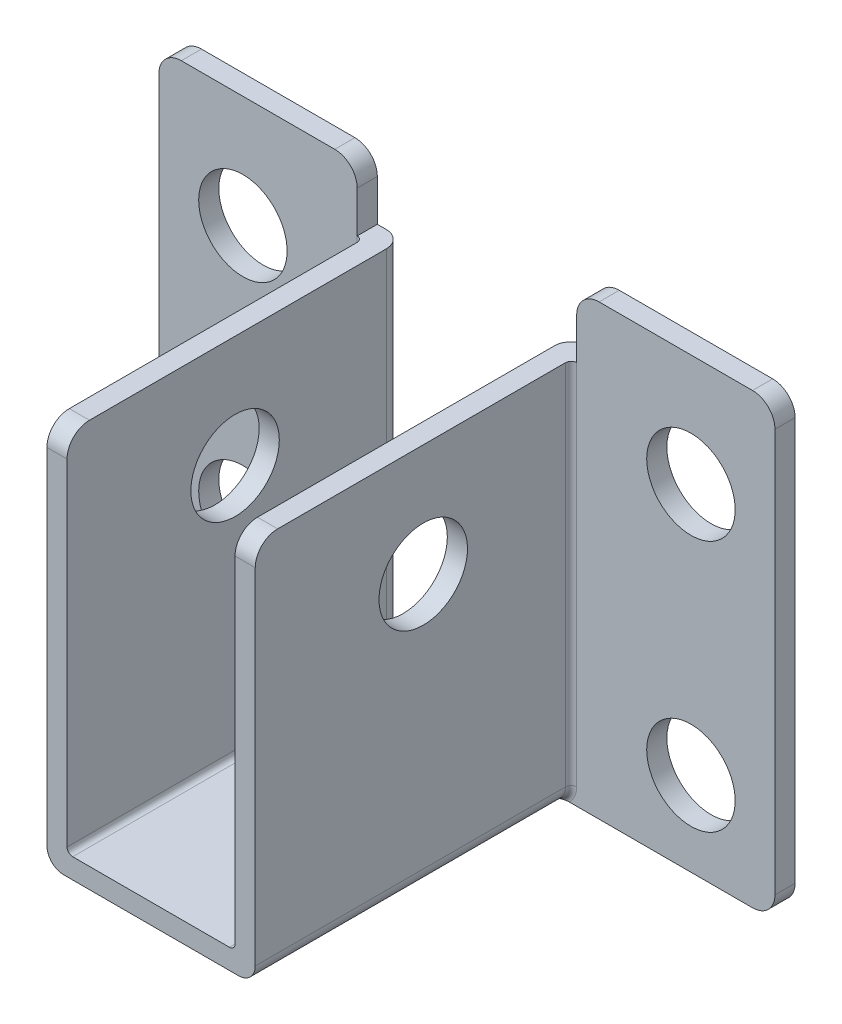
ISO-10303-21;
HEADER;
FILE_DESCRIPTION(('STEP AP214'),'2;1');
FILE_NAME('part.step','',(''),(''),'','','');
FILE_SCHEMA(('AUTOMOTIVE_DESIGN { 1 0 10303 214 1 1 1 1 }'));
ENDSEC;
DATA;
#1=APPLICATION_CONTEXT('core data for automotive mechanical design processes');
#2=APPLICATION_PROTOCOL_DEFINITION('international standard','automotive_design',2000,#1);
#3=PRODUCT_CONTEXT('',#1,'mechanical');
#4=PRODUCT('Part','Part','',(#3));
#5=PRODUCT_RELATED_PRODUCT_CATEGORY('part','',(#4));
#6=PRODUCT_DEFINITION_FORMATION('','',#4);
#7=PRODUCT_DEFINITION_CONTEXT('part definition',#1,'design');
#8=PRODUCT_DEFINITION('design','',#6,#7);
#9=PRODUCT_DEFINITION_SHAPE('','',#8);
#10=(LENGTH_UNIT() NAMED_UNIT(*) SI_UNIT(.MILLI.,.METRE.));
#11=(NAMED_UNIT(*) PLANE_ANGLE_UNIT() SI_UNIT($,.RADIAN.));
#12=(NAMED_UNIT(*) SI_UNIT($,.STERADIAN.) SOLID_ANGLE_UNIT());
#13=UNCERTAINTY_MEASURE_WITH_UNIT(LENGTH_MEASURE(1.E-05),#10,'distance_accuracy_value','');
#14=(GEOMETRIC_REPRESENTATION_CONTEXT(3) GLOBAL_UNCERTAINTY_ASSIGNED_CONTEXT((#13)) GLOBAL_UNIT_ASSIGNED_CONTEXT((#10,
#11,#12)) REPRESENTATION_CONTEXT('',''));
#15=CARTESIAN_POINT('',(0.,0.,0.));
#16=DIRECTION('',(0.,0.,1.));
#17=DIRECTION('',(1.,0.,0.));
#18=AXIS2_PLACEMENT_3D('',#15,#16,#17);
#19=CARTESIAN_POINT('',(9.52500000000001,0.,0.));
#20=DIRECTION('',(0.,0.,1.));
#21=DIRECTION('',(1.,0.,0.));
#22=AXIS2_PLACEMENT_3D('',#19,#20,#21);
#23=PLANE('',#22);
#24=DIRECTION('',(0.,1.,0.));
#25=VECTOR('',#24,1.);
#26=CARTESIAN_POINT('',(34.925,50.8,0.));
#27=LINE('',#26,#25);
#28=CARTESIAN_POINT('',(34.925,2.54,0.));
#29=VERTEX_POINT('',#28);
#30=CARTESIAN_POINT('',(34.925,48.26,0.));
#31=VERTEX_POINT('',#30);
#32=EDGE_CURVE('E352',#29,#31,#27,.T.);
#33=ORIENTED_EDGE('',*,*,#32,.F.);
#34=CARTESIAN_POINT('',(32.385,2.54,0.));
#35=DIRECTION('',(0.,0.,1.));
#36=DIRECTION('',(1.,0.,0.));
#37=AXIS2_PLACEMENT_3D('',#34,#35,#36);
#38=CIRCLE('',#37,2.54);
#39=CARTESIAN_POINT('',(32.385,0.,0.));
#40=VERTEX_POINT('',#39);
#41=EDGE_CURVE('E678',#29,#40,#38,.F.);
#42=ORIENTED_EDGE('',*,*,#41,.T.);
#43=DIRECTION('',(1.,0.,0.));
#44=VECTOR('',#43,1.);
#45=CARTESIAN_POINT('',(9.52500000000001,0.,0.));
#46=LINE('',#45,#44);
#47=CARTESIAN_POINT('',(-32.385,0.,0.));
#48=VERTEX_POINT('',#47);
#49=EDGE_CURVE('E338',#48,#40,#46,.T.);
#50=ORIENTED_EDGE('',*,*,#49,.F.);
#51=CARTESIAN_POINT('',(-32.385,2.54,0.));
#52=DIRECTION('',(0.,0.,1.));
#53=DIRECTION('',(1.,0.,0.));
#54=AXIS2_PLACEMENT_3D('',#51,#52,#53);
#55=CIRCLE('',#54,2.54);
#56=CARTESIAN_POINT('',(-34.925,2.54,0.));
#57=VERTEX_POINT('',#56);
#58=EDGE_CURVE('E675',#48,#57,#55,.F.);
#59=ORIENTED_EDGE('',*,*,#58,.T.);
#60=DIRECTION('',(0.,-1.,0.));
#61=VECTOR('',#60,1.);
#62=CARTESIAN_POINT('',(-34.925,50.8,0.));
#63=LINE('',#62,#61);
#64=CARTESIAN_POINT('',(-34.925,48.26,0.));
#65=VERTEX_POINT('',#64);
#66=EDGE_CURVE('E307',#65,#57,#63,.T.);
#67=ORIENTED_EDGE('',*,*,#66,.F.);
#68=CARTESIAN_POINT('',(-32.385,48.26,0.));
#69=DIRECTION('',(0.,0.,1.));
#70=DIRECTION('',(1.,0.,0.));
#71=AXIS2_PLACEMENT_3D('',#68,#69,#70);
#72=CIRCLE('',#71,2.54);
#73=CARTESIAN_POINT('',(-32.385,50.8,0.));
#74=VERTEX_POINT('',#73);
#75=EDGE_CURVE('E702',#65,#74,#72,.F.);
#76=ORIENTED_EDGE('',*,*,#75,.T.);
#77=DIRECTION('',(-1.,0.,0.));
#78=VECTOR('',#77,1.);
#79=CARTESIAN_POINT('',(-34.925,50.8,0.));
#80=LINE('',#79,#78);
#81=CARTESIAN_POINT('',(-14.986,50.8,0.));
#82=VERTEX_POINT('',#81);
#83=EDGE_CURVE('E302',#82,#74,#80,.T.);
#84=ORIENTED_EDGE('',*,*,#83,.F.);
#85=CARTESIAN_POINT('',(-14.986,48.26,0.));
#86=DIRECTION('',(0.,0.,1.));
#87=DIRECTION('',(1.,0.,0.));
#88=AXIS2_PLACEMENT_3D('',#85,#86,#87);
#89=CIRCLE('',#88,2.54);
#90=CARTESIAN_POINT('',(-12.446,48.26,0.));
#91=VERTEX_POINT('',#90);
#92=EDGE_CURVE('E263',#82,#91,#89,.F.);
#93=ORIENTED_EDGE('',*,*,#92,.T.);
#94=DIRECTION('',(0.,-1.,0.));
#95=VECTOR('',#94,1.);
#96=CARTESIAN_POINT('',(-12.446,43.561,0.));
#97=LINE('',#96,#95);
#98=CARTESIAN_POINT('',(-12.446,43.561,0.));
#99=VERTEX_POINT('',#98);
#100=EDGE_CURVE('E255',#91,#99,#97,.T.);
#101=ORIENTED_EDGE('',*,*,#100,.T.);
#102=DIRECTION('',(1.,0.,0.));
#103=VECTOR('',#102,1.);
#104=CARTESIAN_POINT('',(-12.446,43.561,0.));
#105=LINE('',#104,#103);
#106=CARTESIAN_POINT('',(-11.43,43.561,0.));
#107=VERTEX_POINT('',#106);
#108=EDGE_CURVE('E260',#99,#107,#105,.T.);
#109=ORIENTED_EDGE('',*,*,#108,.T.);
#110=DIRECTION('',(0.,1.,0.));
#111=VECTOR('',#110,1.);
#112=CARTESIAN_POINT('',(-11.43,0.,0.));
#113=LINE('',#112,#111);
#114=CARTESIAN_POINT('',(-11.43,2.92100000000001,0.));
#115=VERTEX_POINT('',#114);
#116=EDGE_CURVE('E358',#107,#115,#113,.F.);
#117=ORIENTED_EDGE('',*,*,#116,.T.);
#118=CARTESIAN_POINT('',(-9.74994791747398,2.286,0.));
#119=CARTESIAN_POINT('',(-9.79794700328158,2.28601233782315,0.));
#120=CARTESIAN_POINT('',(-9.84588089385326,2.28837822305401,0.));
#121=CARTESIAN_POINT('',(-9.9412747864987,2.29720686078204,0.));
#122=CARTESIAN_POINT('',(-9.98873558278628,2.30366084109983,0.));
#123=CARTESIAN_POINT('',(-10.128833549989,2.32802242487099,0.));
#124=CARTESIAN_POINT('',(-10.2205908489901,2.35096646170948,0.));
#125=CARTESIAN_POINT('',(-10.4089432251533,2.40912868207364,0.));
#126=CARTESIAN_POINT('',(-10.5052422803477,2.44525736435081,0.));
#127=CARTESIAN_POINT('',(-10.6945199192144,2.52544582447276,0.));
#128=CARTESIAN_POINT('',(-10.7874945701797,2.56951464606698,0.));
#129=CARTESIAN_POINT('',(-11.0637857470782,2.70964646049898,0.));
#130=CARTESIAN_POINT('',(-11.2432064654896,2.81315580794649,0.));
#131=CARTESIAN_POINT('',(-11.4249601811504,2.91809027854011,0.));
#132=CARTESIAN_POINT('',(-11.4274801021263,2.91954515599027,0.));
#133=CARTESIAN_POINT('',(-11.43,2.92100000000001,0.));
#134=B_SPLINE_CURVE_WITH_KNOTS('',3,(#118,#119,#120,#121,#122,#123,#124,#125,#126,#127,#128,
#129,#130,#131,#132,#133),.UNSPECIFIED.,.F.,.F.,(4,2,2,2,2,2,2,4),(0.,0.14384167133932,
0.28737572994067,0.570275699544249,0.878348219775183,1.1867738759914,1.80764863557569,
1.81637789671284),.UNSPECIFIED.);
#135=CARTESIAN_POINT('',(-9.74994791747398,2.286,0.));
#136=VERTEX_POINT('',#135);
#137=EDGE_CURVE('E421',#115,#136,#134,.F.);
#138=ORIENTED_EDGE('',*,*,#137,.T.);
#139=DIRECTION('',(-1.,0.,0.));
#140=VECTOR('',#139,1.);
#141=CARTESIAN_POINT('',(-9.525,2.286,0.));
#142=LINE('',#141,#140);
#143=CARTESIAN_POINT('',(9.74994791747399,2.286,0.));
#144=VERTEX_POINT('',#143);
#145=EDGE_CURVE('E306',#144,#136,#142,.T.);
#146=ORIENTED_EDGE('',*,*,#145,.F.);
#147=CARTESIAN_POINT('',(9.74994791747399,2.286,0.));
#148=CARTESIAN_POINT('',(9.79794700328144,2.28601233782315,0.));
#149=CARTESIAN_POINT('',(9.84588089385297,2.288378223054,0.));
#150=CARTESIAN_POINT('',(9.94127478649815,2.29720686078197,0.));
#151=CARTESIAN_POINT('',(9.98873558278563,2.30366084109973,0.));
#152=CARTESIAN_POINT('',(10.1288335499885,2.32802242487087,0.));
#153=CARTESIAN_POINT('',(10.2205908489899,2.35096646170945,0.));
#154=CARTESIAN_POINT('',(10.4089432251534,2.40912868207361,0.));
#155=CARTESIAN_POINT('',(10.5052422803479,2.44525736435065,0.));
#156=CARTESIAN_POINT('',(10.6945199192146,2.52544582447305,0.));
#157=CARTESIAN_POINT('',(10.7874945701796,2.56951464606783,0.));
#158=CARTESIAN_POINT('',(11.0637857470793,2.70964646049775,0.));
#159=CARTESIAN_POINT('',(11.2432064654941,2.81315580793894,0.));
#160=CARTESIAN_POINT('',(11.4249601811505,2.9180902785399,0.));
#161=CARTESIAN_POINT('',(11.4274801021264,2.91954515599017,0.));
#162=CARTESIAN_POINT('',(11.43,2.92100000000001,0.));
#163=B_SPLINE_CURVE_WITH_KNOTS('',3,(#147,#148,#149,#150,#151,#152,#153,#154,#155,#156,#157,
#158,#159,#160,#161,#162),.UNSPECIFIED.,.F.,.F.,(4,2,2,2,2,2,2,4),(0.,0.143841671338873,
0.287375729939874,0.57027569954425,0.878348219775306,1.18677387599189,1.80764863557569,
1.81637789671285),.UNSPECIFIED.);
#164=CARTESIAN_POINT('',(11.43,2.92100000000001,0.));
#165=VERTEX_POINT('',#164);
#166=EDGE_CURVE('E428',#144,#165,#163,.T.);
#167=ORIENTED_EDGE('',*,*,#166,.T.);
#168=DIRECTION('',(0.,-1.,0.));
#169=VECTOR('',#168,1.);
#170=CARTESIAN_POINT('',(11.43,0.,0.));
#171=LINE('',#170,#169);
#172=CARTESIAN_POINT('',(11.43,43.561,0.));
#173=VERTEX_POINT('',#172);
#174=EDGE_CURVE('E360',#165,#173,#171,.F.);
#175=ORIENTED_EDGE('',*,*,#174,.T.);
#176=CARTESIAN_POINT('',(12.446,43.561,0.));
#177=VERTEX_POINT('',#176);
#178=EDGE_CURVE('E266',#173,#177,#105,.T.);
#179=ORIENTED_EDGE('',*,*,#178,.T.);
#180=DIRECTION('',(0.,1.,0.));
#181=VECTOR('',#180,1.);
#182=CARTESIAN_POINT('',(12.446,43.561,0.));
#183=LINE('',#182,#181);
#184=CARTESIAN_POINT('',(12.446,48.26,0.));
#185=VERTEX_POINT('',#184);
#186=EDGE_CURVE('E282',#177,#185,#183,.T.);
#187=ORIENTED_EDGE('',*,*,#186,.T.);
#188=CARTESIAN_POINT('',(14.986,48.26,0.));
#189=DIRECTION('',(0.,0.,1.));
#190=DIRECTION('',(1.,0.,0.));
#191=AXIS2_PLACEMENT_3D('',#188,#189,#190);
#192=CIRCLE('',#191,2.54);
#193=CARTESIAN_POINT('',(14.986,50.8,0.));
#194=VERTEX_POINT('',#193);
#195=EDGE_CURVE('E697',#185,#194,#192,.F.);
#196=ORIENTED_EDGE('',*,*,#195,.T.);
#197=DIRECTION('',(-1.,0.,0.));
#198=VECTOR('',#197,1.);
#199=CARTESIAN_POINT('',(9.525,50.8,0.));
#200=LINE('',#199,#198);
#201=CARTESIAN_POINT('',(32.385,50.8,0.));
#202=VERTEX_POINT('',#201);
#203=EDGE_CURVE('E343',#202,#194,#200,.T.);
#204=ORIENTED_EDGE('',*,*,#203,.F.);
#205=CARTESIAN_POINT('',(32.385,48.26,0.));
#206=DIRECTION('',(0.,0.,1.));
#207=DIRECTION('',(1.,0.,0.));
#208=AXIS2_PLACEMENT_3D('',#205,#206,#207);
#209=CIRCLE('',#208,2.54);
#210=EDGE_CURVE('E695',#202,#31,#209,.F.);
#211=ORIENTED_EDGE('',*,*,#210,.T.);
#212=EDGE_LOOP('',(#33,#42,#50,#59,#67,#76,#84,#93,#101,#109,#117,#138,#146,#167,#175,#179,#187,
#196,#204,#211));
#213=FACE_BOUND('',#212,.T.);
#214=CARTESIAN_POINT('',(-25.4,38.1,0.));
#215=DIRECTION('',(0.,0.,1.));
#216=DIRECTION('',(1.,0.,0.));
#217=AXIS2_PLACEMENT_3D('',#214,#215,#216);
#218=CIRCLE('',#217,5.0165);
#219=CARTESIAN_POINT('',(-30.4165,38.1,0.));
#220=VERTEX_POINT('',#219);
#221=EDGE_CURVE('E545',#220,#220,#218,.T.);
#222=ORIENTED_EDGE('',*,*,#221,.T.);
#223=EDGE_LOOP('',(#222));
#224=FACE_BOUND('',#223,.T.);
#225=CARTESIAN_POINT('',(25.4,38.1,0.));
#226=DIRECTION('',(0.,0.,1.));
#227=DIRECTION('',(1.,0.,0.));
#228=AXIS2_PLACEMENT_3D('',#225,#226,#227);
#229=CIRCLE('',#228,5.0165);
#230=CARTESIAN_POINT('',(20.3835,38.1,0.));
#231=VERTEX_POINT('',#230);
#232=EDGE_CURVE('E549',#231,#231,#229,.T.);
#233=ORIENTED_EDGE('',*,*,#232,.T.);
#234=EDGE_LOOP('',(#233));
#235=FACE_BOUND('',#234,.T.);
#236=CARTESIAN_POINT('',(25.4,9.525,0.));
#237=DIRECTION('',(0.,0.,1.));
#238=DIRECTION('',(1.,0.,0.));
#239=AXIS2_PLACEMENT_3D('',#236,#237,#238);
#240=CIRCLE('',#239,5.0165);
#241=CARTESIAN_POINT('',(20.3835,9.525,0.));
#242=VERTEX_POINT('',#241);
#243=EDGE_CURVE('E552',#242,#242,#240,.T.);
#244=ORIENTED_EDGE('',*,*,#243,.T.);
#245=EDGE_LOOP('',(#244));
#246=FACE_BOUND('',#245,.T.);
#247=CARTESIAN_POINT('',(-25.4,9.525,0.));
#248=DIRECTION('',(0.,0.,1.));
#249=DIRECTION('',(1.,0.,0.));
#250=AXIS2_PLACEMENT_3D('',#247,#248,#249);
#251=CIRCLE('',#250,5.0165);
#252=CARTESIAN_POINT('',(-30.4165,9.525,0.));
#253=VERTEX_POINT('',#252);
#254=EDGE_CURVE('E555',#253,#253,#251,.T.);
#255=ORIENTED_EDGE('',*,*,#254,.T.);
#256=EDGE_LOOP('',(#255));
#257=FACE_BOUND('',#256,.T.);
#258=ADVANCED_FACE('F37',(#213,#224,#235,#246,#257),#23,.F.);
#259=CARTESIAN_POINT('',(-34.925,0.,2.286));
#260=DIRECTION('',(0.,0.,1.));
#261=DIRECTION('',(1.,0.,0.));
#262=AXIS2_PLACEMENT_3D('',#259,#260,#261);
#263=PLANE('',#262);
#264=CARTESIAN_POINT('',(-25.4,38.1,2.286));
#265=DIRECTION('',(0.,0.,1.));
#266=DIRECTION('',(1.,0.,0.));
#267=AXIS2_PLACEMENT_3D('',#264,#265,#266);
#268=CIRCLE('',#267,5.0165);
#269=CARTESIAN_POINT('',(-30.4165,38.1,2.286));
#270=VERTEX_POINT('',#269);
#271=EDGE_CURVE('E267',#270,#270,#268,.F.);
#272=ORIENTED_EDGE('',*,*,#271,.T.);
#273=EDGE_LOOP('',(#272));
#274=FACE_BOUND('',#273,.T.);
#275=DIRECTION('',(0.,-1.,0.));
#276=VECTOR('',#275,1.);
#277=CARTESIAN_POINT('',(-34.925,50.8,2.286));
#278=LINE('',#277,#276);
#279=CARTESIAN_POINT('',(-34.925,48.26,2.286));
#280=VERTEX_POINT('',#279);
#281=CARTESIAN_POINT('',(-34.925,2.54,2.286));
#282=VERTEX_POINT('',#281);
#283=EDGE_CURVE('E298',#280,#282,#278,.T.);
#284=ORIENTED_EDGE('',*,*,#283,.T.);
#285=CARTESIAN_POINT('',(-32.385,2.54,2.286));
#286=DIRECTION('',(0.,0.,1.));
#287=DIRECTION('',(1.,0.,0.));
#288=AXIS2_PLACEMENT_3D('',#285,#286,#287);
#289=CIRCLE('',#288,2.54);
#290=CARTESIAN_POINT('',(-32.385,0.,2.286));
#291=VERTEX_POINT('',#290);
#292=EDGE_CURVE('E525',#282,#291,#289,.T.);
#293=ORIENTED_EDGE('',*,*,#292,.T.);
#294=DIRECTION('',(1.,0.,0.));
#295=VECTOR('',#294,1.);
#296=CARTESIAN_POINT('',(-34.925,0.,2.286));
#297=LINE('',#296,#295);
#298=CARTESIAN_POINT('',(-11.586052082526,0.,2.286));
#299=VERTEX_POINT('',#298);
#300=EDGE_CURVE('E301',#291,#299,#297,.T.);
#301=ORIENTED_EDGE('',*,*,#300,.T.);
#302=CARTESIAN_POINT('',(-9.906,1.905,2.286));
#303=DIRECTION('',(0.,0.,1.));
#304=DIRECTION('',(1.,0.,0.));
#305=AXIS2_PLACEMENT_3D('',#302,#303,#304);
#306=CIRCLE('',#305,2.54);
#307=CARTESIAN_POINT('',(-12.446,1.905,2.286));
#308=VERTEX_POINT('',#307);
#309=EDGE_CURVE('E399',#299,#308,#306,.F.);
#310=ORIENTED_EDGE('',*,*,#309,.T.);
#311=DIRECTION('',(0.,-1.,0.));
#312=VECTOR('',#311,1.);
#313=CARTESIAN_POINT('',(-12.446,0.,2.286));
#314=LINE('',#313,#312);
#315=CARTESIAN_POINT('',(-12.446,43.561,2.286));
#316=VERTEX_POINT('',#315);
#317=EDGE_CURVE('E397',#308,#316,#314,.F.);
#318=ORIENTED_EDGE('',*,*,#317,.T.);
#319=DIRECTION('',(0.,1.,0.));
#320=VECTOR('',#319,1.);
#321=CARTESIAN_POINT('',(-12.446,0.,2.286));
#322=LINE('',#321,#320);
#323=CARTESIAN_POINT('',(-12.446,48.26,2.286));
#324=VERTEX_POINT('',#323);
#325=EDGE_CURVE('E272',#316,#324,#322,.T.);
#326=ORIENTED_EDGE('',*,*,#325,.T.);
#327=CARTESIAN_POINT('',(-14.986,48.26,2.286));
#328=DIRECTION('',(0.,0.,1.));
#329=DIRECTION('',(1.,0.,0.));
#330=AXIS2_PLACEMENT_3D('',#327,#328,#329);
#331=CIRCLE('',#330,2.54);
#332=CARTESIAN_POINT('',(-14.986,50.8,2.286));
#333=VERTEX_POINT('',#332);
#334=EDGE_CURVE('E61',#324,#333,#331,.T.);
#335=ORIENTED_EDGE('',*,*,#334,.T.);
#336=DIRECTION('',(-1.,0.,0.));
#337=VECTOR('',#336,1.);
#338=CARTESIAN_POINT('',(-34.925,50.8,2.286));
#339=LINE('',#338,#337);
#340=CARTESIAN_POINT('',(-32.385,50.8,2.286));
#341=VERTEX_POINT('',#340);
#342=EDGE_CURVE('E304',#333,#341,#339,.T.);
#343=ORIENTED_EDGE('',*,*,#342,.T.);
#344=CARTESIAN_POINT('',(-32.385,48.26,2.286));
#345=DIRECTION('',(0.,0.,1.));
#346=DIRECTION('',(1.,0.,0.));
#347=AXIS2_PLACEMENT_3D('',#344,#345,#346);
#348=CIRCLE('',#347,2.54);
#349=EDGE_CURVE('E526',#341,#280,#348,.T.);
#350=ORIENTED_EDGE('',*,*,#349,.T.);
#351=EDGE_LOOP('',(#284,#293,#301,#310,#318,#326,#335,#343,#350));
#352=FACE_BOUND('',#351,.T.);
#353=CARTESIAN_POINT('',(-25.4,9.525,2.286));
#354=DIRECTION('',(0.,0.,1.));
#355=DIRECTION('',(1.,0.,0.));
#356=AXIS2_PLACEMENT_3D('',#353,#354,#355);
#357=CIRCLE('',#356,5.0165);
#358=CARTESIAN_POINT('',(-30.4165,9.525,2.286));
#359=VERTEX_POINT('',#358);
#360=EDGE_CURVE('E553',#359,#359,#357,.F.);
#361=ORIENTED_EDGE('',*,*,#360,.T.);
#362=EDGE_LOOP('',(#361));
#363=FACE_BOUND('',#362,.T.);
#364=ADVANCED_FACE('F442',(#274,#352,#363),#263,.T.);
#365=CARTESIAN_POINT('',(9.52500000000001,0.,2.286));
#366=DIRECTION('',(0.,0.,1.));
#367=DIRECTION('',(1.,0.,0.));
#368=AXIS2_PLACEMENT_3D('',#365,#366,#367);
#369=PLANE('',#368);
#370=CARTESIAN_POINT('',(25.4,38.1,2.286));
#371=DIRECTION('',(0.,0.,1.));
#372=DIRECTION('',(1.,0.,0.));
#373=AXIS2_PLACEMENT_3D('',#370,#371,#372);
#374=CIRCLE('',#373,5.0165);
#375=CARTESIAN_POINT('',(20.3835,38.1,2.286));
#376=VERTEX_POINT('',#375);
#377=EDGE_CURVE('E546',#376,#376,#374,.F.);
#378=ORIENTED_EDGE('',*,*,#377,.T.);
#379=EDGE_LOOP('',(#378));
#380=FACE_BOUND('',#379,.T.);
#381=DIRECTION('',(1.,0.,0.));
#382=VECTOR('',#381,1.);
#383=CARTESIAN_POINT('',(9.52500000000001,0.,2.286));
#384=LINE('',#383,#382);
#385=CARTESIAN_POINT('',(11.586052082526,0.,2.286));
#386=VERTEX_POINT('',#385);
#387=CARTESIAN_POINT('',(32.385,0.,2.286));
#388=VERTEX_POINT('',#387);
#389=EDGE_CURVE('E339',#386,#388,#384,.T.);
#390=ORIENTED_EDGE('',*,*,#389,.T.);
#391=CARTESIAN_POINT('',(32.385,2.54,2.286));
#392=DIRECTION('',(0.,0.,1.));
#393=DIRECTION('',(1.,0.,0.));
#394=AXIS2_PLACEMENT_3D('',#391,#392,#393);
#395=CIRCLE('',#394,2.54);
#396=CARTESIAN_POINT('',(34.925,2.54,2.286));
#397=VERTEX_POINT('',#396);
#398=EDGE_CURVE('E644',#388,#397,#395,.T.);
#399=ORIENTED_EDGE('',*,*,#398,.T.);
#400=DIRECTION('',(0.,1.,0.));
#401=VECTOR('',#400,1.);
#402=CARTESIAN_POINT('',(34.925,50.8,2.286));
#403=LINE('',#402,#401);
#404=CARTESIAN_POINT('',(34.925,48.26,2.286));
#405=VERTEX_POINT('',#404);
#406=EDGE_CURVE('E342',#397,#405,#403,.T.);
#407=ORIENTED_EDGE('',*,*,#406,.T.);
#408=CARTESIAN_POINT('',(32.385,48.26,2.286));
#409=DIRECTION('',(0.,0.,1.));
#410=DIRECTION('',(1.,0.,0.));
#411=AXIS2_PLACEMENT_3D('',#408,#409,#410);
#412=CIRCLE('',#411,2.54);
#413=CARTESIAN_POINT('',(32.385,50.8,2.286));
#414=VERTEX_POINT('',#413);
#415=EDGE_CURVE('E649',#405,#414,#412,.T.);
#416=ORIENTED_EDGE('',*,*,#415,.T.);
#417=DIRECTION('',(-1.,0.,0.));
#418=VECTOR('',#417,1.);
#419=CARTESIAN_POINT('',(9.525,50.8,2.286));
#420=LINE('',#419,#418);
#421=CARTESIAN_POINT('',(14.986,50.8,2.286));
#422=VERTEX_POINT('',#421);
#423=EDGE_CURVE('E346',#414,#422,#420,.T.);
#424=ORIENTED_EDGE('',*,*,#423,.T.);
#425=CARTESIAN_POINT('',(14.986,48.26,2.286));
#426=DIRECTION('',(0.,0.,1.));
#427=DIRECTION('',(1.,0.,0.));
#428=AXIS2_PLACEMENT_3D('',#425,#426,#427);
#429=CIRCLE('',#428,2.54);
#430=CARTESIAN_POINT('',(12.446,48.26,2.286));
#431=VERTEX_POINT('',#430);
#432=EDGE_CURVE('E680',#422,#431,#429,.T.);
#433=ORIENTED_EDGE('',*,*,#432,.T.);
#434=DIRECTION('',(0.,-1.,0.));
#435=VECTOR('',#434,1.);
#436=CARTESIAN_POINT('',(12.446,0.,2.286));
#437=LINE('',#436,#435);
#438=CARTESIAN_POINT('',(12.446,43.561,2.286));
#439=VERTEX_POINT('',#438);
#440=EDGE_CURVE('E295',#431,#439,#437,.T.);
#441=ORIENTED_EDGE('',*,*,#440,.T.);
#442=DIRECTION('',(0.,-1.,0.));
#443=VECTOR('',#442,1.);
#444=CARTESIAN_POINT('',(12.446,0.,2.286));
#445=LINE('',#444,#443);
#446=CARTESIAN_POINT('',(12.446,1.905,2.286));
#447=VERTEX_POINT('',#446);
#448=EDGE_CURVE('E404',#439,#447,#445,.T.);
#449=ORIENTED_EDGE('',*,*,#448,.T.);
#450=CARTESIAN_POINT('',(9.906,1.905,2.286));
#451=DIRECTION('',(0.,0.,1.));
#452=DIRECTION('',(1.,0.,0.));
#453=AXIS2_PLACEMENT_3D('',#450,#451,#452);
#454=CIRCLE('',#453,2.54);
#455=EDGE_CURVE('E406',#447,#386,#454,.F.);
#456=ORIENTED_EDGE('',*,*,#455,.T.);
#457=EDGE_LOOP('',(#390,#399,#407,#416,#424,#433,#441,#449,#456));
#458=FACE_BOUND('',#457,.T.);
#459=CARTESIAN_POINT('',(25.4,9.525,2.286));
#460=DIRECTION('',(0.,0.,1.));
#461=DIRECTION('',(1.,0.,0.));
#462=AXIS2_PLACEMENT_3D('',#459,#460,#461);
#463=CIRCLE('',#462,5.0165);
#464=CARTESIAN_POINT('',(20.3835,9.525,2.286));
#465=VERTEX_POINT('',#464);
#466=EDGE_CURVE('E550',#465,#465,#463,.F.);
#467=ORIENTED_EDGE('',*,*,#466,.T.);
#468=EDGE_LOOP('',(#467));
#469=FACE_BOUND('',#468,.T.);
#470=ADVANCED_FACE('F443',(#380,#458,#469),#369,.T.);
#471=CARTESIAN_POINT('',(9.525,50.8,2.286));
#472=DIRECTION('',(1.,0.,0.));
#473=DIRECTION('',(0.,1.,0.));
#474=AXIS2_PLACEMENT_3D('',#471,#472,#473);
#475=PLANE('',#474);
#476=CARTESIAN_POINT('',(9.525,30.861,19.05));
#477=DIRECTION('',(1.,0.,0.));
#478=DIRECTION('',(0.,1.,0.));
#479=AXIS2_PLACEMENT_3D('',#476,#477,#478);
#480=CIRCLE('',#479,5.0165);
#481=CARTESIAN_POINT('',(9.525,35.8775,19.05));
#482=VERTEX_POINT('',#481);
#483=EDGE_CURVE('E561',#482,#482,#480,.T.);
#484=ORIENTED_EDGE('',*,*,#483,.T.);
#485=EDGE_LOOP('',(#484));
#486=FACE_BOUND('',#485,.T.);
#487=DIRECTION('',(0.,-1.,0.));
#488=VECTOR('',#487,1.);
#489=CARTESIAN_POINT('',(9.52500000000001,43.561,38.1));
#490=LINE('',#489,#488);
#491=CARTESIAN_POINT('',(9.52500000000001,41.021,38.1));
#492=VERTEX_POINT('',#491);
#493=CARTESIAN_POINT('',(9.525,2.92100000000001,38.1));
#494=VERTEX_POINT('',#493);
#495=EDGE_CURVE('E320',#492,#494,#490,.T.);
#496=ORIENTED_EDGE('',*,*,#495,.F.);
#497=CARTESIAN_POINT('',(9.525,41.021,35.56));
#498=DIRECTION('',(1.,0.,0.));
#499=DIRECTION('',(0.,1.,0.));
#500=AXIS2_PLACEMENT_3D('',#497,#498,#499);
#501=CIRCLE('',#500,2.54);
#502=CARTESIAN_POINT('',(9.52500000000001,43.561,35.56));
#503=VERTEX_POINT('',#502);
#504=EDGE_CURVE('E647',#492,#503,#501,.F.);
#505=ORIENTED_EDGE('',*,*,#504,.T.);
#506=DIRECTION('',(0.,0.,-1.));
#507=VECTOR('',#506,1.);
#508=CARTESIAN_POINT('',(9.52500000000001,43.561,38.1));
#509=LINE('',#508,#507);
#510=CARTESIAN_POINT('',(9.525,43.561,1.905));
#511=VERTEX_POINT('',#510);
#512=EDGE_CURVE('E334',#503,#511,#509,.T.);
#513=ORIENTED_EDGE('',*,*,#512,.T.);
#514=DIRECTION('',(0.,-1.,0.));
#515=VECTOR('',#514,1.);
#516=CARTESIAN_POINT('',(9.525,50.8,1.905));
#517=LINE('',#516,#515);
#518=CARTESIAN_POINT('',(9.52500000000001,2.92100000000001,1.905));
#519=VERTEX_POINT('',#518);
#520=EDGE_CURVE('E349',#511,#519,#517,.T.);
#521=ORIENTED_EDGE('',*,*,#520,.T.);
#522=DIRECTION('',(0.,0.,-1.));
#523=VECTOR('',#522,1.);
#524=CARTESIAN_POINT('',(9.52500000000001,2.921,38.1));
#525=LINE('',#524,#523);
#526=EDGE_CURVE('E413',#519,#494,#525,.F.);
#527=ORIENTED_EDGE('',*,*,#526,.T.);
#528=EDGE_LOOP('',(#496,#505,#513,#521,#527));
#529=FACE_BOUND('',#528,.T.);
#530=ADVANCED_FACE('F450',(#486,#529),#475,.F.);
#531=CARTESIAN_POINT('',(9.525,50.8,2.286));
#532=DIRECTION('',(0.,-1.,0.));
#533=DIRECTION('',(0.,0.,-1.));
#534=AXIS2_PLACEMENT_3D('',#531,#532,#533);
#535=PLANE('',#534);
#536=ORIENTED_EDGE('',*,*,#423,.F.);
#537=DIRECTION('',(0.,0.,-1.));
#538=VECTOR('',#537,1.);
#539=CARTESIAN_POINT('',(32.385,50.8,2.286));
#540=LINE('',#539,#538);
#541=EDGE_CURVE('E535',#414,#202,#540,.T.);
#542=ORIENTED_EDGE('',*,*,#541,.T.);
#543=ORIENTED_EDGE('',*,*,#203,.T.);
#544=DIRECTION('',(0.,0.,-1.));
#545=VECTOR('',#544,1.);
#546=CARTESIAN_POINT('',(14.986,50.8,2.28600000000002));
#547=LINE('',#546,#545);
#548=EDGE_CURVE('E528',#194,#422,#547,.F.);
#549=ORIENTED_EDGE('',*,*,#548,.T.);
#550=EDGE_LOOP('',(#536,#542,#543,#549));
#551=FACE_BOUND('',#550,.T.);
#552=ADVANCED_FACE('F445',(#551),#535,.F.);
#553=CARTESIAN_POINT('',(-9.52500000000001,43.561,38.1));
#554=DIRECTION('',(-1.,0.,0.));
#555=DIRECTION('',(0.,-1.,0.));
#556=AXIS2_PLACEMENT_3D('',#553,#554,#555);
#557=PLANE('',#556);
#558=CARTESIAN_POINT('',(-9.525,30.861,19.05));
#559=DIRECTION('',(-1.,0.,0.));
#560=DIRECTION('',(0.,-1.,0.));
#561=AXIS2_PLACEMENT_3D('',#558,#559,#560);
#562=CIRCLE('',#561,5.0165);
#563=CARTESIAN_POINT('',(-9.525,30.861,14.0335));
#564=VERTEX_POINT('',#563);
#565=EDGE_CURVE('E566',#564,#564,#562,.T.);
#566=ORIENTED_EDGE('',*,*,#565,.T.);
#567=EDGE_LOOP('',(#566));
#568=FACE_BOUND('',#567,.T.);
#569=DIRECTION('',(0.,0.,-1.));
#570=VECTOR('',#569,1.);
#571=CARTESIAN_POINT('',(-9.52500000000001,43.561,38.1));
#572=LINE('',#571,#570);
#573=CARTESIAN_POINT('',(-9.52500000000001,43.561,35.56));
#574=VERTEX_POINT('',#573);
#575=CARTESIAN_POINT('',(-9.52500000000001,43.561,1.905));
#576=VERTEX_POINT('',#575);
#577=EDGE_CURVE('E332',#574,#576,#572,.T.);
#578=ORIENTED_EDGE('',*,*,#577,.F.);
#579=CARTESIAN_POINT('',(-9.52500000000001,41.021,35.56));
#580=DIRECTION('',(-1.,0.,0.));
#581=DIRECTION('',(0.,-1.,0.));
#582=AXIS2_PLACEMENT_3D('',#579,#580,#581);
#583=CIRCLE('',#582,2.54);
#584=CARTESIAN_POINT('',(-9.52500000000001,41.021,38.1));
#585=VERTEX_POINT('',#584);
#586=EDGE_CURVE('E661',#574,#585,#583,.F.);
#587=ORIENTED_EDGE('',*,*,#586,.T.);
#588=DIRECTION('',(0.,1.,0.));
#589=VECTOR('',#588,1.);
#590=CARTESIAN_POINT('',(-9.52500000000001,43.561,38.1));
#591=LINE('',#590,#589);
#592=CARTESIAN_POINT('',(-9.525,2.92100000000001,38.1));
#593=VERTEX_POINT('',#592);
#594=EDGE_CURVE('E325',#593,#585,#591,.T.);
#595=ORIENTED_EDGE('',*,*,#594,.F.);
#596=DIRECTION('',(0.,0.,-1.));
#597=VECTOR('',#596,1.);
#598=CARTESIAN_POINT('',(-9.525,2.92100000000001,1.90500000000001));
#599=LINE('',#598,#597);
#600=CARTESIAN_POINT('',(-9.525,2.92100000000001,1.905));
#601=VERTEX_POINT('',#600);
#602=EDGE_CURVE('E411',#593,#601,#599,.T.);
#603=ORIENTED_EDGE('',*,*,#602,.T.);
#604=DIRECTION('',(0.,1.,0.));
#605=VECTOR('',#604,1.);
#606=CARTESIAN_POINT('',(-9.52500000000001,43.561,1.905));
#607=LINE('',#606,#605);
#608=EDGE_CURVE('E363',#601,#576,#607,.T.);
#609=ORIENTED_EDGE('',*,*,#608,.T.);
#610=EDGE_LOOP('',(#578,#587,#595,#603,#609));
#611=FACE_BOUND('',#610,.T.);
#612=ADVANCED_FACE('F449',(#568,#611),#557,.F.);
#613=CARTESIAN_POINT('',(-34.925,50.8,2.286));
#614=DIRECTION('',(0.,-1.,0.));
#615=DIRECTION('',(0.,0.,-1.));
#616=AXIS2_PLACEMENT_3D('',#613,#614,#615);
#617=PLANE('',#616);
#618=ORIENTED_EDGE('',*,*,#342,.F.);
#619=DIRECTION('',(0.,0.,-1.));
#620=VECTOR('',#619,1.);
#621=CARTESIAN_POINT('',(-14.986,50.8,0.));
#622=LINE('',#621,#620);
#623=EDGE_CURVE('E46',#333,#82,#622,.T.);
#624=ORIENTED_EDGE('',*,*,#623,.T.);
#625=ORIENTED_EDGE('',*,*,#83,.T.);
#626=DIRECTION('',(0.,0.,-1.));
#627=VECTOR('',#626,1.);
#628=CARTESIAN_POINT('',(-32.385,50.8,2.286));
#629=LINE('',#628,#627);
#630=EDGE_CURVE('E54',#74,#341,#629,.F.);
#631=ORIENTED_EDGE('',*,*,#630,.T.);
#632=EDGE_LOOP('',(#618,#624,#625,#631));
#633=FACE_BOUND('',#632,.T.);
#634=ADVANCED_FACE('F596',(#633),#617,.F.);
#635=CARTESIAN_POINT('',(11.43,50.8,1.905));
#636=DIRECTION('',(0.,-1.,0.));
#637=DIRECTION('',(1.,0.,0.));
#638=AXIS2_PLACEMENT_3D('',#635,#636,#637);
#639=CYLINDRICAL_SURFACE('',#638,1.905);
#640=ORIENTED_EDGE('',*,*,#520,.F.);
#641=CARTESIAN_POINT('',(11.43,43.561,1.905));
#642=DIRECTION('',(0.,1.,0.));
#643=DIRECTION('',(0.,0.,1.));
#644=AXIS2_PLACEMENT_3D('',#641,#642,#643);
#645=CIRCLE('',#644,1.905);
#646=EDGE_CURVE('E291',#511,#173,#645,.F.);
#647=ORIENTED_EDGE('',*,*,#646,.T.);
#648=ORIENTED_EDGE('',*,*,#174,.F.);
#649=CARTESIAN_POINT('',(11.43,2.92100000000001,1.905));
#650=DIRECTION('',(0.,-1.,0.));
#651=DIRECTION('',(0.,0.,-1.));
#652=AXIS2_PLACEMENT_3D('',#649,#650,#651);
#653=CIRCLE('',#652,1.905);
#654=EDGE_CURVE('E394',#165,#519,#653,.F.);
#655=ORIENTED_EDGE('',*,*,#654,.T.);
#656=EDGE_LOOP('',(#640,#647,#648,#655));
#657=FACE_BOUND('',#656,.T.);
#658=ADVANCED_FACE('F599',(#657),#639,.T.);
#659=CARTESIAN_POINT('',(-11.43,43.561,1.905));
#660=DIRECTION('',(0.,1.,0.));
#661=DIRECTION('',(-1.,0.,0.));
#662=AXIS2_PLACEMENT_3D('',#659,#660,#661);
#663=CYLINDRICAL_SURFACE('',#662,1.905);
#664=ORIENTED_EDGE('',*,*,#116,.F.);
#665=CARTESIAN_POINT('',(-11.43,43.561,1.905));
#666=DIRECTION('',(0.,1.,0.));
#667=DIRECTION('',(0.,0.,1.));
#668=AXIS2_PLACEMENT_3D('',#665,#666,#667);
#669=CIRCLE('',#668,1.905);
#670=EDGE_CURVE('E276',#107,#576,#669,.F.);
#671=ORIENTED_EDGE('',*,*,#670,.T.);
#672=ORIENTED_EDGE('',*,*,#608,.F.);
#673=CARTESIAN_POINT('',(-11.43,2.92100000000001,1.905));
#674=DIRECTION('',(0.,-1.,0.));
#675=DIRECTION('',(0.,0.,-1.));
#676=AXIS2_PLACEMENT_3D('',#673,#674,#675);
#677=CIRCLE('',#676,1.905);
#678=EDGE_CURVE('E391',#601,#115,#677,.F.);
#679=ORIENTED_EDGE('',*,*,#678,.T.);
#680=EDGE_LOOP('',(#664,#671,#672,#679));
#681=FACE_BOUND('',#680,.T.);
#682=ADVANCED_FACE('F461',(#681),#663,.T.);
#683=CARTESIAN_POINT('',(9.52500000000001,0.,2.286));
#684=DIRECTION('',(0.,1.,0.));
#685=DIRECTION('',(0.,0.,1.));
#686=AXIS2_PLACEMENT_3D('',#683,#684,#685);
#687=PLANE('',#686);
#688=ORIENTED_EDGE('',*,*,#49,.T.);
#689=DIRECTION('',(0.,0.,-1.));
#690=VECTOR('',#689,1.);
#691=CARTESIAN_POINT('',(32.385,0.,2.286));
#692=LINE('',#691,#690);
#693=EDGE_CURVE('E677',#40,#388,#692,.F.);
#694=ORIENTED_EDGE('',*,*,#693,.T.);
#695=ORIENTED_EDGE('',*,*,#389,.F.);
#696=CARTESIAN_POINT('',(11.586052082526,0.,2.286));
#697=CARTESIAN_POINT('',(11.5380529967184,0.,2.28601233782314));
#698=CARTESIAN_POINT('',(11.4901191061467,0.,2.288378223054));
#699=CARTESIAN_POINT('',(11.3947252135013,0.,2.29720686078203));
#700=CARTESIAN_POINT('',(11.3472644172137,0.,2.30366084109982));
#701=CARTESIAN_POINT('',(11.207166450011,0.,2.32802242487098));
#702=CARTESIAN_POINT('',(11.1154091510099,0.,2.35096646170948));
#703=CARTESIAN_POINT('',(10.9270567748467,0.,2.40912868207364));
#704=CARTESIAN_POINT('',(10.8307577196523,0.,2.4452573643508));
#705=CARTESIAN_POINT('',(10.6414800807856,0.,2.52544582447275));
#706=CARTESIAN_POINT('',(10.5485054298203,0.,2.56951464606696));
#707=CARTESIAN_POINT('',(10.2722142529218,0.,2.70964646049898));
#708=CARTESIAN_POINT('',(10.0927935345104,0.,2.81315580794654));
#709=CARTESIAN_POINT('',(9.91103981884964,0.,2.91809027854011));
#710=CARTESIAN_POINT('',(9.90851989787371,0.,2.91954515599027));
#711=CARTESIAN_POINT('',(9.906,0.,2.921));
#712=B_SPLINE_CURVE_WITH_KNOTS('',3,(#696,#697,#698,#699,#700,#701,#702,#703,#704,#705,#706,
#707,#708,#709,#710,#711),.UNSPECIFIED.,.F.,.F.,(4,2,2,2,2,2,2,4),(0.,0.143841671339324,
0.287375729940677,0.570275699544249,0.878348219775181,1.18677387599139,1.80764863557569,
1.81637789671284),.UNSPECIFIED.);
#713=CARTESIAN_POINT('',(9.906,0.,2.921));
#714=VERTEX_POINT('',#713);
#715=EDGE_CURVE('E471',#386,#714,#712,.T.);
#716=ORIENTED_EDGE('',*,*,#715,.T.);
#717=DIRECTION('',(0.,0.,-1.));
#718=VECTOR('',#717,1.);
#719=CARTESIAN_POINT('',(9.906,0.,2.286));
#720=LINE('',#719,#718);
#721=CARTESIAN_POINT('',(9.906,0.,38.1));
#722=VERTEX_POINT('',#721);
#723=EDGE_CURVE('E372',#714,#722,#720,.F.);
#724=ORIENTED_EDGE('',*,*,#723,.T.);
#725=DIRECTION('',(1.,0.,0.));
#726=VECTOR('',#725,1.);
#727=CARTESIAN_POINT('',(-11.811,0.,38.1));
#728=LINE('',#727,#726);
#729=CARTESIAN_POINT('',(-9.906,0.,38.1));
#730=VERTEX_POINT('',#729);
#731=EDGE_CURVE('E314',#730,#722,#728,.T.);
#732=ORIENTED_EDGE('',*,*,#731,.F.);
#733=DIRECTION('',(0.,0.,-1.));
#734=VECTOR('',#733,1.);
#735=CARTESIAN_POINT('',(-9.906,0.,2.286));
#736=LINE('',#735,#734);
#737=CARTESIAN_POINT('',(-9.906,0.,2.921));
#738=VERTEX_POINT('',#737);
#739=EDGE_CURVE('E369',#730,#738,#736,.T.);
#740=ORIENTED_EDGE('',*,*,#739,.T.);
#741=CARTESIAN_POINT('',(-11.586052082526,0.,2.286));
#742=CARTESIAN_POINT('',(-11.5380529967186,0.,2.28601233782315));
#743=CARTESIAN_POINT('',(-11.490119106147,0.,2.28837822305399));
#744=CARTESIAN_POINT('',(-11.3947252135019,0.,2.29720686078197));
#745=CARTESIAN_POINT('',(-11.3472644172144,0.,2.30366084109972));
#746=CARTESIAN_POINT('',(-11.2071664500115,0.,2.32802242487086));
#747=CARTESIAN_POINT('',(-11.1154091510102,0.,2.35096646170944));
#748=CARTESIAN_POINT('',(-10.9270567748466,0.,2.4091286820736));
#749=CARTESIAN_POINT('',(-10.8307577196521,0.,2.44525736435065));
#750=CARTESIAN_POINT('',(-10.6414800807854,0.,2.52544582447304));
#751=CARTESIAN_POINT('',(-10.5485054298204,0.,2.56951464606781));
#752=CARTESIAN_POINT('',(-10.2722142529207,0.,2.70964646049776));
#753=CARTESIAN_POINT('',(-10.0927935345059,0.,2.813155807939));
#754=CARTESIAN_POINT('',(-9.91103981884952,0.,2.91809027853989));
#755=CARTESIAN_POINT('',(-9.90851989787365,0.,2.91954515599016));
#756=CARTESIAN_POINT('',(-9.906,0.,2.921));
#757=B_SPLINE_CURVE_WITH_KNOTS('',3,(#741,#742,#743,#744,#745,#746,#747,#748,#749,#750,#751,
#752,#753,#754,#755,#756),.UNSPECIFIED.,.F.,.F.,(4,2,2,2,2,2,2,4),(0.,0.143841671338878,
0.287375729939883,0.570275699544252,0.878348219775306,1.18677387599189,1.80764863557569,
1.81637789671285),.UNSPECIFIED.);
#758=EDGE_CURVE('E465',#738,#299,#757,.F.);
#759=ORIENTED_EDGE('',*,*,#758,.T.);
#760=ORIENTED_EDGE('',*,*,#300,.F.);
#761=DIRECTION('',(0.,0.,-1.));
#762=VECTOR('',#761,1.);
#763=CARTESIAN_POINT('',(-32.385,0.,2.286));
#764=LINE('',#763,#762);
#765=EDGE_CURVE('E674',#291,#48,#764,.T.);
#766=ORIENTED_EDGE('',*,*,#765,.T.);
#767=EDGE_LOOP('',(#688,#694,#695,#716,#724,#732,#740,#759,#760,#766));
#768=FACE_BOUND('',#767,.T.);
#769=ADVANCED_FACE('F456',(#768),#687,.F.);
#770=CARTESIAN_POINT('',(34.925,50.8,2.286));
#771=DIRECTION('',(-1.,0.,0.));
#772=DIRECTION('',(0.,-1.,0.));
#773=AXIS2_PLACEMENT_3D('',#770,#771,#772);
#774=PLANE('',#773);
#775=ORIENTED_EDGE('',*,*,#406,.F.);
#776=DIRECTION('',(0.,0.,-1.));
#777=VECTOR('',#776,1.);
#778=CARTESIAN_POINT('',(34.925,2.54,2.286));
#779=LINE('',#778,#777);
#780=EDGE_CURVE('E704',#397,#29,#779,.T.);
#781=ORIENTED_EDGE('',*,*,#780,.T.);
#782=ORIENTED_EDGE('',*,*,#32,.T.);
#783=DIRECTION('',(0.,0.,-1.));
#784=VECTOR('',#783,1.);
#785=CARTESIAN_POINT('',(34.925,48.26,2.286));
#786=LINE('',#785,#784);
#787=EDGE_CURVE('E696',#31,#405,#786,.F.);
#788=ORIENTED_EDGE('',*,*,#787,.T.);
#789=EDGE_LOOP('',(#775,#781,#782,#788));
#790=FACE_BOUND('',#789,.T.);
#791=ADVANCED_FACE('F452',(#790),#774,.F.);
#792=CARTESIAN_POINT('',(-11.811,43.561,38.1));
#793=DIRECTION('',(1.,0.,0.));
#794=DIRECTION('',(0.,1.,0.));
#795=AXIS2_PLACEMENT_3D('',#792,#793,#794);
#796=PLANE('',#795);
#797=CARTESIAN_POINT('',(-11.811,30.861,19.05));
#798=DIRECTION('',(1.,0.,0.));
#799=DIRECTION('',(0.,1.,0.));
#800=AXIS2_PLACEMENT_3D('',#797,#798,#799);
#801=CIRCLE('',#800,5.0165);
#802=CARTESIAN_POINT('',(-11.811,30.861,14.0335));
#803=VERTEX_POINT('',#802);
#804=EDGE_CURVE('E632',#803,#803,#801,.T.);
#805=ORIENTED_EDGE('',*,*,#804,.T.);
#806=EDGE_LOOP('',(#805));
#807=FACE_BOUND('',#806,.T.);
#808=DIRECTION('',(0.,-1.,0.));
#809=VECTOR('',#808,1.);
#810=CARTESIAN_POINT('',(-11.811,43.561,38.1));
#811=LINE('',#810,#809);
#812=CARTESIAN_POINT('',(-11.811,41.021,38.1));
#813=VERTEX_POINT('',#812);
#814=CARTESIAN_POINT('',(-11.811,1.905,38.1));
#815=VERTEX_POINT('',#814);
#816=EDGE_CURVE('E312',#813,#815,#811,.T.);
#817=ORIENTED_EDGE('',*,*,#816,.F.);
#818=CARTESIAN_POINT('',(-11.811,41.021,35.56));
#819=DIRECTION('',(1.,0.,0.));
#820=DIRECTION('',(0.,1.,0.));
#821=AXIS2_PLACEMENT_3D('',#818,#819,#820);
#822=CIRCLE('',#821,2.54);
#823=CARTESIAN_POINT('',(-11.811,43.561,35.56));
#824=VERTEX_POINT('',#823);
#825=EDGE_CURVE('E634',#813,#824,#822,.F.);
#826=ORIENTED_EDGE('',*,*,#825,.T.);
#827=DIRECTION('',(0.,0.,-1.));
#828=VECTOR('',#827,1.);
#829=CARTESIAN_POINT('',(-11.811,43.561,38.1));
#830=LINE('',#829,#828);
#831=CARTESIAN_POINT('',(-11.811,43.561,2.92100000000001));
#832=VERTEX_POINT('',#831);
#833=EDGE_CURVE('E328',#824,#832,#830,.T.);
#834=ORIENTED_EDGE('',*,*,#833,.T.);
#835=DIRECTION('',(0.,-1.,0.));
#836=VECTOR('',#835,1.);
#837=CARTESIAN_POINT('',(-11.811,43.561,2.921));
#838=LINE('',#837,#836);
#839=CARTESIAN_POINT('',(-11.811,1.905,2.921));
#840=VERTEX_POINT('',#839);
#841=EDGE_CURVE('E416',#832,#840,#838,.T.);
#842=ORIENTED_EDGE('',*,*,#841,.T.);
#843=DIRECTION('',(0.,0.,-1.));
#844=VECTOR('',#843,1.);
#845=CARTESIAN_POINT('',(-11.811,1.905,38.1));
#846=LINE('',#845,#844);
#847=EDGE_CURVE('E378',#840,#815,#846,.F.);
#848=ORIENTED_EDGE('',*,*,#847,.T.);
#849=EDGE_LOOP('',(#817,#826,#834,#842,#848));
#850=FACE_BOUND('',#849,.T.);
#851=ADVANCED_FACE('F455',(#807,#850),#796,.F.);
#852=CARTESIAN_POINT('',(11.811,43.561,38.1));
#853=DIRECTION('',(-1.,0.,0.));
#854=DIRECTION('',(0.,-1.,0.));
#855=AXIS2_PLACEMENT_3D('',#852,#853,#854);
#856=PLANE('',#855);
#857=CARTESIAN_POINT('',(11.811,30.861,19.05));
#858=DIRECTION('',(-1.,0.,0.));
#859=DIRECTION('',(0.,-1.,0.));
#860=AXIS2_PLACEMENT_3D('',#857,#858,#859);
#861=CIRCLE('',#860,5.0165);
#862=CARTESIAN_POINT('',(11.811,25.8445,19.05));
#863=VERTEX_POINT('',#862);
#864=EDGE_CURVE('E41',#863,#863,#861,.T.);
#865=ORIENTED_EDGE('',*,*,#864,.T.);
#866=EDGE_LOOP('',(#865));
#867=FACE_BOUND('',#866,.T.);
#868=DIRECTION('',(0.,0.,-1.));
#869=VECTOR('',#868,1.);
#870=CARTESIAN_POINT('',(11.811,43.561,38.1));
#871=LINE('',#870,#869);
#872=CARTESIAN_POINT('',(11.811,43.561,35.56));
#873=VERTEX_POINT('',#872);
#874=CARTESIAN_POINT('',(11.811,43.561,2.92100000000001));
#875=VERTEX_POINT('',#874);
#876=EDGE_CURVE('E336',#873,#875,#871,.T.);
#877=ORIENTED_EDGE('',*,*,#876,.F.);
#878=CARTESIAN_POINT('',(11.811,41.021,35.56));
#879=DIRECTION('',(-1.,0.,0.));
#880=DIRECTION('',(0.,-1.,0.));
#881=AXIS2_PLACEMENT_3D('',#878,#879,#880);
#882=CIRCLE('',#881,2.54);
#883=CARTESIAN_POINT('',(11.811,41.021,38.1));
#884=VERTEX_POINT('',#883);
#885=EDGE_CURVE('E656',#873,#884,#882,.F.);
#886=ORIENTED_EDGE('',*,*,#885,.T.);
#887=DIRECTION('',(0.,1.,0.));
#888=VECTOR('',#887,1.);
#889=CARTESIAN_POINT('',(11.811,43.561,38.1));
#890=LINE('',#889,#888);
#891=CARTESIAN_POINT('',(11.811,1.905,38.1));
#892=VERTEX_POINT('',#891);
#893=EDGE_CURVE('E317',#892,#884,#890,.T.);
#894=ORIENTED_EDGE('',*,*,#893,.F.);
#895=DIRECTION('',(0.,0.,-1.));
#896=VECTOR('',#895,1.);
#897=CARTESIAN_POINT('',(11.811,1.905,38.1));
#898=LINE('',#897,#896);
#899=CARTESIAN_POINT('',(11.811,1.905,2.921));
#900=VERTEX_POINT('',#899);
#901=EDGE_CURVE('E366',#892,#900,#898,.T.);
#902=ORIENTED_EDGE('',*,*,#901,.T.);
#903=DIRECTION('',(0.,-1.,0.));
#904=VECTOR('',#903,1.);
#905=CARTESIAN_POINT('',(11.811,43.561,2.921));
#906=LINE('',#905,#904);
#907=EDGE_CURVE('E418',#900,#875,#906,.F.);
#908=ORIENTED_EDGE('',*,*,#907,.T.);
#909=EDGE_LOOP('',(#877,#886,#894,#902,#908));
#910=FACE_BOUND('',#909,.T.);
#911=ADVANCED_FACE('F621',(#867,#910),#856,.F.);
#912=CARTESIAN_POINT('',(9.52500000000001,43.561,38.1));
#913=DIRECTION('',(0.,-1.,0.));
#914=DIRECTION('',(0.,0.,-1.));
#915=AXIS2_PLACEMENT_3D('',#912,#913,#914);
#916=PLANE('',#915);
#917=ORIENTED_EDGE('',*,*,#512,.F.);
#918=DIRECTION('',(-1.,0.,0.));
#919=VECTOR('',#918,1.);
#920=CARTESIAN_POINT('',(11.811,43.561,35.56));
#921=LINE('',#920,#919);
#922=EDGE_CURVE('E654',#503,#873,#921,.F.);
#923=ORIENTED_EDGE('',*,*,#922,.T.);
#924=ORIENTED_EDGE('',*,*,#876,.T.);
#925=CARTESIAN_POINT('',(12.446,43.561,2.921));
#926=DIRECTION('',(0.,-1.,0.));
#927=DIRECTION('',(0.,0.,-1.));
#928=AXIS2_PLACEMENT_3D('',#925,#926,#927);
#929=CIRCLE('',#928,0.635);
#930=EDGE_CURVE('E708',#875,#439,#929,.T.);
#931=ORIENTED_EDGE('',*,*,#930,.T.);
#932=DIRECTION('',(0.,0.,-1.));
#933=VECTOR('',#932,1.);
#934=CARTESIAN_POINT('',(12.446,43.561,38.1));
#935=LINE('',#934,#933);
#936=EDGE_CURVE('E277',#439,#177,#935,.T.);
#937=ORIENTED_EDGE('',*,*,#936,.T.);
#938=ORIENTED_EDGE('',*,*,#178,.F.);
#939=ORIENTED_EDGE('',*,*,#646,.F.);
#940=EDGE_LOOP('',(#917,#923,#924,#931,#937,#938,#939));
#941=FACE_BOUND('',#940,.T.);
#942=ADVANCED_FACE('F617',(#941),#916,.F.);
#943=CARTESIAN_POINT('',(-9.525,2.286,38.1));
#944=DIRECTION('',(0.,-1.,0.));
#945=DIRECTION('',(0.,0.,-1.));
#946=AXIS2_PLACEMENT_3D('',#943,#944,#945);
#947=PLANE('',#946);
#948=ORIENTED_EDGE('',*,*,#145,.T.);
#949=CARTESIAN_POINT('',(-11.43,2.286,1.905));
#950=DIRECTION('',(0.,-1.,0.));
#951=DIRECTION('',(0.,0.,-1.));
#952=AXIS2_PLACEMENT_3D('',#949,#950,#951);
#953=CIRCLE('',#952,2.54);
#954=CARTESIAN_POINT('',(-8.89,2.286,1.905));
#955=VERTEX_POINT('',#954);
#956=EDGE_CURVE('E388',#136,#955,#953,.T.);
#957=ORIENTED_EDGE('',*,*,#956,.T.);
#958=DIRECTION('',(0.,0.,-1.));
#959=VECTOR('',#958,1.);
#960=CARTESIAN_POINT('',(-8.89,2.286,38.1));
#961=LINE('',#960,#959);
#962=CARTESIAN_POINT('',(-8.89,2.286,38.1));
#963=VERTEX_POINT('',#962);
#964=EDGE_CURVE('E386',#955,#963,#961,.F.);
#965=ORIENTED_EDGE('',*,*,#964,.T.);
#966=DIRECTION('',(-1.,0.,0.));
#967=VECTOR('',#966,1.);
#968=CARTESIAN_POINT('',(-9.525,2.286,38.1));
#969=LINE('',#968,#967);
#970=CARTESIAN_POINT('',(8.89000000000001,2.286,38.1));
#971=VERTEX_POINT('',#970);
#972=EDGE_CURVE('E322',#971,#963,#969,.T.);
#973=ORIENTED_EDGE('',*,*,#972,.F.);
#974=DIRECTION('',(0.,0.,-1.));
#975=VECTOR('',#974,1.);
#976=CARTESIAN_POINT('',(8.89000000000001,2.286,1.90500000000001));
#977=LINE('',#976,#975);
#978=CARTESIAN_POINT('',(8.89000000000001,2.286,1.905));
#979=VERTEX_POINT('',#978);
#980=EDGE_CURVE('E381',#971,#979,#977,.T.);
#981=ORIENTED_EDGE('',*,*,#980,.T.);
#982=CARTESIAN_POINT('',(11.43,2.286,1.905));
#983=DIRECTION('',(0.,-1.,0.));
#984=DIRECTION('',(0.,0.,-1.));
#985=AXIS2_PLACEMENT_3D('',#982,#983,#984);
#986=CIRCLE('',#985,2.54);
#987=EDGE_CURVE('E383',#979,#144,#986,.T.);
#988=ORIENTED_EDGE('',*,*,#987,.T.);
#989=EDGE_LOOP('',(#948,#957,#965,#973,#981,#988));
#990=FACE_BOUND('',#989,.T.);
#991=ADVANCED_FACE('F611',(#990),#947,.F.);
#992=CARTESIAN_POINT('',(-11.811,43.561,38.1));
#993=DIRECTION('',(0.,-1.,0.));
#994=DIRECTION('',(0.,0.,-1.));
#995=AXIS2_PLACEMENT_3D('',#992,#993,#994);
#996=PLANE('',#995);
#997=ORIENTED_EDGE('',*,*,#833,.F.);
#998=DIRECTION('',(-1.,0.,0.));
#999=VECTOR('',#998,1.);
#1000=CARTESIAN_POINT('',(-9.52500000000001,43.561,35.56));
#1001=LINE('',#1000,#999);
#1002=EDGE_CURVE('E659',#824,#574,#1001,.F.);
#1003=ORIENTED_EDGE('',*,*,#1002,.T.);
#1004=ORIENTED_EDGE('',*,*,#577,.T.);
#1005=ORIENTED_EDGE('',*,*,#670,.F.);
#1006=ORIENTED_EDGE('',*,*,#108,.F.);
#1007=DIRECTION('',(0.,0.,-1.));
#1008=VECTOR('',#1007,1.);
#1009=CARTESIAN_POINT('',(-12.446,43.561,38.1));
#1010=LINE('',#1009,#1008);
#1011=EDGE_CURVE('E270',#316,#99,#1010,.T.);
#1012=ORIENTED_EDGE('',*,*,#1011,.F.);
#1013=CARTESIAN_POINT('',(-12.446,43.561,2.921));
#1014=DIRECTION('',(0.,-1.,0.));
#1015=DIRECTION('',(0.,0.,-1.));
#1016=AXIS2_PLACEMENT_3D('',#1013,#1014,#1015);
#1017=CIRCLE('',#1016,0.635);
#1018=EDGE_CURVE('E719',#316,#832,#1017,.T.);
#1019=ORIENTED_EDGE('',*,*,#1018,.T.);
#1020=EDGE_LOOP('',(#997,#1003,#1004,#1005,#1006,#1012,#1019));
#1021=FACE_BOUND('',#1020,.T.);
#1022=ADVANCED_FACE('F280',(#1021),#996,.F.);
#1023=CARTESIAN_POINT('',(-11.811,0.,38.1));
#1024=DIRECTION('',(0.,0.,1.));
#1025=DIRECTION('',(1.,0.,0.));
#1026=AXIS2_PLACEMENT_3D('',#1023,#1024,#1025);
#1027=PLANE('',#1026);
#1028=ORIENTED_EDGE('',*,*,#893,.T.);
#1029=DIRECTION('',(-1.,0.,0.));
#1030=VECTOR('',#1029,1.);
#1031=CARTESIAN_POINT('',(9.52500000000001,41.021,38.1));
#1032=LINE('',#1031,#1030);
#1033=EDGE_CURVE('E643',#884,#492,#1032,.T.);
#1034=ORIENTED_EDGE('',*,*,#1033,.T.);
#1035=ORIENTED_EDGE('',*,*,#495,.T.);
#1036=CARTESIAN_POINT('',(8.89000000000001,2.921,38.1));
#1037=DIRECTION('',(0.,0.,1.));
#1038=DIRECTION('',(1.,0.,0.));
#1039=AXIS2_PLACEMENT_3D('',#1036,#1037,#1038);
#1040=CIRCLE('',#1039,0.635);
#1041=EDGE_CURVE('E720',#494,#971,#1040,.F.);
#1042=ORIENTED_EDGE('',*,*,#1041,.T.);
#1043=ORIENTED_EDGE('',*,*,#972,.T.);
#1044=CARTESIAN_POINT('',(-8.89,2.92100000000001,38.1));
#1045=DIRECTION('',(0.,0.,1.));
#1046=DIRECTION('',(1.,0.,0.));
#1047=AXIS2_PLACEMENT_3D('',#1044,#1045,#1046);
#1048=CIRCLE('',#1047,0.635);
#1049=EDGE_CURVE('E477',#963,#593,#1048,.F.);
#1050=ORIENTED_EDGE('',*,*,#1049,.T.);
#1051=ORIENTED_EDGE('',*,*,#594,.T.);
#1052=DIRECTION('',(-1.,0.,0.));
#1053=VECTOR('',#1052,1.);
#1054=CARTESIAN_POINT('',(-11.811,41.021,38.1));
#1055=LINE('',#1054,#1053);
#1056=EDGE_CURVE('E640',#585,#813,#1055,.T.);
#1057=ORIENTED_EDGE('',*,*,#1056,.T.);
#1058=ORIENTED_EDGE('',*,*,#816,.T.);
#1059=CARTESIAN_POINT('',(-9.906,1.905,38.1));
#1060=DIRECTION('',(0.,0.,1.));
#1061=DIRECTION('',(1.,0.,0.));
#1062=AXIS2_PLACEMENT_3D('',#1059,#1060,#1061);
#1063=CIRCLE('',#1062,1.905);
#1064=EDGE_CURVE('E374',#815,#730,#1063,.T.);
#1065=ORIENTED_EDGE('',*,*,#1064,.T.);
#1066=ORIENTED_EDGE('',*,*,#731,.T.);
#1067=CARTESIAN_POINT('',(9.906,1.905,38.1));
#1068=DIRECTION('',(0.,0.,1.));
#1069=DIRECTION('',(1.,0.,0.));
#1070=AXIS2_PLACEMENT_3D('',#1067,#1068,#1069);
#1071=CIRCLE('',#1070,1.905);
#1072=EDGE_CURVE('E376',#722,#892,#1071,.T.);
#1073=ORIENTED_EDGE('',*,*,#1072,.T.);
#1074=EDGE_LOOP('',(#1028,#1034,#1035,#1042,#1043,#1050,#1051,#1057,#1058,#1065,#1066,#1073));
#1075=FACE_BOUND('',#1074,.T.);
#1076=ADVANCED_FACE('F604',(#1075),#1027,.T.);
#1077=CARTESIAN_POINT('',(-34.925,50.8,2.286));
#1078=DIRECTION('',(1.,0.,0.));
#1079=DIRECTION('',(0.,1.,0.));
#1080=AXIS2_PLACEMENT_3D('',#1077,#1078,#1079);
#1081=PLANE('',#1080);
#1082=ORIENTED_EDGE('',*,*,#66,.T.);
#1083=DIRECTION('',(0.,0.,-1.));
#1084=VECTOR('',#1083,1.);
#1085=CARTESIAN_POINT('',(-34.925,2.54,2.286));
#1086=LINE('',#1085,#1084);
#1087=EDGE_CURVE('E530',#57,#282,#1086,.F.);
#1088=ORIENTED_EDGE('',*,*,#1087,.T.);
#1089=ORIENTED_EDGE('',*,*,#283,.F.);
#1090=DIRECTION('',(0.,0.,-1.));
#1091=VECTOR('',#1090,1.);
#1092=CARTESIAN_POINT('',(-34.925,48.26,2.286));
#1093=LINE('',#1092,#1091);
#1094=EDGE_CURVE('E663',#280,#65,#1093,.T.);
#1095=ORIENTED_EDGE('',*,*,#1094,.T.);
#1096=EDGE_LOOP('',(#1082,#1088,#1089,#1095));
#1097=FACE_BOUND('',#1096,.T.);
#1098=ADVANCED_FACE('F600',(#1097),#1081,.F.);
#1099=CARTESIAN_POINT('',(9.906,1.905,38.1));
#1100=DIRECTION('',(0.,0.,-1.));
#1101=DIRECTION('',(-1.,0.,0.));
#1102=AXIS2_PLACEMENT_3D('',#1099,#1100,#1101);
#1103=CYLINDRICAL_SURFACE('',#1102,1.905);
#1104=ORIENTED_EDGE('',*,*,#723,.F.);
#1105=CARTESIAN_POINT('',(9.906,1.905,2.921));
#1106=DIRECTION('',(0.,0.,1.));
#1107=DIRECTION('',(1.,0.,0.));
#1108=AXIS2_PLACEMENT_3D('',#1105,#1106,#1107);
#1109=CIRCLE('',#1108,1.905);
#1110=EDGE_CURVE('E409',#714,#900,#1109,.T.);
#1111=ORIENTED_EDGE('',*,*,#1110,.T.);
#1112=ORIENTED_EDGE('',*,*,#901,.F.);
#1113=ORIENTED_EDGE('',*,*,#1072,.F.);
#1114=EDGE_LOOP('',(#1104,#1111,#1112,#1113));
#1115=FACE_BOUND('',#1114,.T.);
#1116=ADVANCED_FACE('F603',(#1115),#1103,.T.);
#1117=CARTESIAN_POINT('',(-9.906,1.905,2.286));
#1118=DIRECTION('',(0.,0.,-1.));
#1119=DIRECTION('',(-1.,0.,0.));
#1120=AXIS2_PLACEMENT_3D('',#1117,#1118,#1119);
#1121=CYLINDRICAL_SURFACE('',#1120,1.905);
#1122=ORIENTED_EDGE('',*,*,#847,.F.);
#1123=CARTESIAN_POINT('',(-9.906,1.905,2.921));
#1124=DIRECTION('',(0.,0.,1.));
#1125=DIRECTION('',(1.,0.,0.));
#1126=AXIS2_PLACEMENT_3D('',#1123,#1124,#1125);
#1127=CIRCLE('',#1126,1.905);
#1128=EDGE_CURVE('E402',#840,#738,#1127,.T.);
#1129=ORIENTED_EDGE('',*,*,#1128,.T.);
#1130=ORIENTED_EDGE('',*,*,#739,.F.);
#1131=ORIENTED_EDGE('',*,*,#1064,.F.);
#1132=EDGE_LOOP('',(#1122,#1129,#1130,#1131));
#1133=FACE_BOUND('',#1132,.T.);
#1134=ADVANCED_FACE('F744',(#1133),#1121,.T.);
#1135=CARTESIAN_POINT('',(-8.89,2.92100000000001,38.1));
#1136=DIRECTION('',(0.,0.,1.));
#1137=DIRECTION('',(1.,0.,0.));
#1138=AXIS2_PLACEMENT_3D('',#1135,#1136,#1137);
#1139=CYLINDRICAL_SURFACE('',#1138,0.635);
#1140=ORIENTED_EDGE('',*,*,#1049,.F.);
#1141=ORIENTED_EDGE('',*,*,#964,.F.);
#1142=CARTESIAN_POINT('',(-8.89,2.92100000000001,1.905));
#1143=DIRECTION('',(0.,0.,1.));
#1144=DIRECTION('',(1.,0.,0.));
#1145=AXIS2_PLACEMENT_3D('',#1142,#1143,#1144);
#1146=CIRCLE('',#1145,0.635);
#1147=EDGE_CURVE('E310',#601,#955,#1146,.T.);
#1148=ORIENTED_EDGE('',*,*,#1147,.F.);
#1149=ORIENTED_EDGE('',*,*,#602,.F.);
#1150=EDGE_LOOP('',(#1140,#1141,#1148,#1149));
#1151=FACE_BOUND('',#1150,.T.);
#1152=ADVANCED_FACE('F731',(#1151),#1139,.F.);
#1153=CARTESIAN_POINT('',(-11.43,2.92100000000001,1.905));
#1154=DIRECTION('',(0.,-1.,0.));
#1155=DIRECTION('',(0.,0.,-1.));
#1156=AXIS2_PLACEMENT_3D('',#1153,#1154,#1155);
#1157=TOROIDAL_SURFACE('',#1156,2.54,0.635);
#1158=ORIENTED_EDGE('',*,*,#137,.F.);
#1159=ORIENTED_EDGE('',*,*,#678,.F.);
#1160=ORIENTED_EDGE('',*,*,#1147,.T.);
#1161=ORIENTED_EDGE('',*,*,#956,.F.);
#1162=EDGE_LOOP('',(#1158,#1159,#1160,#1161));
#1163=FACE_BOUND('',#1162,.T.);
#1164=ADVANCED_FACE('F434',(#1163),#1157,.F.);
#1165=CARTESIAN_POINT('',(8.89000000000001,2.921,38.1));
#1166=DIRECTION('',(0.,0.,1.));
#1167=DIRECTION('',(1.,0.,0.));
#1168=AXIS2_PLACEMENT_3D('',#1165,#1166,#1167);
#1169=CYLINDRICAL_SURFACE('',#1168,0.635);
#1170=ORIENTED_EDGE('',*,*,#1041,.F.);
#1171=ORIENTED_EDGE('',*,*,#526,.F.);
#1172=CARTESIAN_POINT('',(8.89000000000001,2.921,1.905));
#1173=DIRECTION('',(0.,0.,1.));
#1174=DIRECTION('',(1.,0.,0.));
#1175=AXIS2_PLACEMENT_3D('',#1172,#1173,#1174);
#1176=CIRCLE('',#1175,0.635);
#1177=EDGE_CURVE('E713',#979,#519,#1176,.T.);
#1178=ORIENTED_EDGE('',*,*,#1177,.F.);
#1179=ORIENTED_EDGE('',*,*,#980,.F.);
#1180=EDGE_LOOP('',(#1170,#1171,#1178,#1179));
#1181=FACE_BOUND('',#1180,.T.);
#1182=ADVANCED_FACE('F764',(#1181),#1169,.F.);
#1183=CARTESIAN_POINT('',(11.43,2.92100000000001,1.905));
#1184=DIRECTION('',(0.,-1.,0.));
#1185=DIRECTION('',(0.,0.,-1.));
#1186=AXIS2_PLACEMENT_3D('',#1183,#1184,#1185);
#1187=TOROIDAL_SURFACE('',#1186,2.54,0.635);
#1188=ORIENTED_EDGE('',*,*,#1177,.T.);
#1189=ORIENTED_EDGE('',*,*,#654,.F.);
#1190=ORIENTED_EDGE('',*,*,#166,.F.);
#1191=ORIENTED_EDGE('',*,*,#987,.F.);
#1192=EDGE_LOOP('',(#1188,#1189,#1190,#1191));
#1193=FACE_BOUND('',#1192,.T.);
#1194=ADVANCED_FACE('F760',(#1193),#1187,.F.);
#1195=CARTESIAN_POINT('',(-12.446,43.561,2.921));
#1196=DIRECTION('',(0.,-1.,0.));
#1197=DIRECTION('',(1.,0.,0.));
#1198=AXIS2_PLACEMENT_3D('',#1195,#1196,#1197);
#1199=CYLINDRICAL_SURFACE('',#1198,0.635);
#1200=ORIENTED_EDGE('',*,*,#1018,.F.);
#1201=ORIENTED_EDGE('',*,*,#317,.F.);
#1202=CARTESIAN_POINT('',(-12.446,1.905,2.921));
#1203=DIRECTION('',(0.,1.,0.));
#1204=DIRECTION('',(0.,0.,1.));
#1205=AXIS2_PLACEMENT_3D('',#1202,#1203,#1204);
#1206=CIRCLE('',#1205,0.635);
#1207=EDGE_CURVE('E711',#840,#308,#1206,.T.);
#1208=ORIENTED_EDGE('',*,*,#1207,.F.);
#1209=ORIENTED_EDGE('',*,*,#841,.F.);
#1210=EDGE_LOOP('',(#1200,#1201,#1208,#1209));
#1211=FACE_BOUND('',#1210,.T.);
#1212=ADVANCED_FACE('F486',(#1211),#1199,.F.);
#1213=CARTESIAN_POINT('',(-9.906,1.905,2.921));
#1214=DIRECTION('',(0.,0.,1.));
#1215=DIRECTION('',(1.,0.,0.));
#1216=AXIS2_PLACEMENT_3D('',#1213,#1214,#1215);
#1217=TOROIDAL_SURFACE('',#1216,2.54,0.635);
#1218=ORIENTED_EDGE('',*,*,#758,.F.);
#1219=ORIENTED_EDGE('',*,*,#1128,.F.);
#1220=ORIENTED_EDGE('',*,*,#1207,.T.);
#1221=ORIENTED_EDGE('',*,*,#309,.F.);
#1222=EDGE_LOOP('',(#1218,#1219,#1220,#1221));
#1223=FACE_BOUND('',#1222,.T.);
#1224=ADVANCED_FACE('F489',(#1223),#1217,.F.);
#1225=CARTESIAN_POINT('',(12.446,0.,2.921));
#1226=DIRECTION('',(0.,-1.,0.));
#1227=DIRECTION('',(1.,0.,0.));
#1228=AXIS2_PLACEMENT_3D('',#1225,#1226,#1227);
#1229=CYLINDRICAL_SURFACE('',#1228,0.635);
#1230=ORIENTED_EDGE('',*,*,#930,.F.);
#1231=ORIENTED_EDGE('',*,*,#907,.F.);
#1232=CARTESIAN_POINT('',(12.446,1.905,2.921));
#1233=DIRECTION('',(0.,1.,0.));
#1234=DIRECTION('',(0.,0.,1.));
#1235=AXIS2_PLACEMENT_3D('',#1232,#1233,#1234);
#1236=CIRCLE('',#1235,0.635);
#1237=EDGE_CURVE('E297',#447,#900,#1236,.T.);
#1238=ORIENTED_EDGE('',*,*,#1237,.F.);
#1239=ORIENTED_EDGE('',*,*,#448,.F.);
#1240=EDGE_LOOP('',(#1230,#1231,#1238,#1239));
#1241=FACE_BOUND('',#1240,.T.);
#1242=ADVANCED_FACE('F484',(#1241),#1229,.F.);
#1243=CARTESIAN_POINT('',(9.906,1.905,2.921));
#1244=DIRECTION('',(0.,0.,1.));
#1245=DIRECTION('',(1.,0.,0.));
#1246=AXIS2_PLACEMENT_3D('',#1243,#1244,#1245);
#1247=TOROIDAL_SURFACE('',#1246,2.54,0.635);
#1248=ORIENTED_EDGE('',*,*,#1237,.T.);
#1249=ORIENTED_EDGE('',*,*,#1110,.F.);
#1250=ORIENTED_EDGE('',*,*,#715,.F.);
#1251=ORIENTED_EDGE('',*,*,#455,.F.);
#1252=EDGE_LOOP('',(#1248,#1249,#1250,#1251));
#1253=FACE_BOUND('',#1252,.T.);
#1254=ADVANCED_FACE('F479',(#1253),#1247,.F.);
#1255=CARTESIAN_POINT('',(-12.446,43.561,38.1));
#1256=DIRECTION('',(1.,0.,0.));
#1257=DIRECTION('',(0.,0.,-1.));
#1258=AXIS2_PLACEMENT_3D('',#1255,#1256,#1257);
#1259=PLANE('',#1258);
#1260=ORIENTED_EDGE('',*,*,#100,.F.);
#1261=DIRECTION('',(0.,0.,-1.));
#1262=VECTOR('',#1261,1.);
#1263=CARTESIAN_POINT('',(-12.446,48.26,2.28600000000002));
#1264=LINE('',#1263,#1262);
#1265=EDGE_CURVE('E11',#91,#324,#1264,.F.);
#1266=ORIENTED_EDGE('',*,*,#1265,.T.);
#1267=ORIENTED_EDGE('',*,*,#325,.F.);
#1268=ORIENTED_EDGE('',*,*,#1011,.T.);
#1269=EDGE_LOOP('',(#1260,#1266,#1267,#1268));
#1270=FACE_BOUND('',#1269,.T.);
#1271=ADVANCED_FACE('F271',(#1270),#1259,.T.);
#1272=CARTESIAN_POINT('',(12.446,43.561,38.1));
#1273=DIRECTION('',(-1.,0.,0.));
#1274=DIRECTION('',(0.,0.,1.));
#1275=AXIS2_PLACEMENT_3D('',#1272,#1273,#1274);
#1276=PLANE('',#1275);
#1277=ORIENTED_EDGE('',*,*,#440,.F.);
#1278=DIRECTION('',(0.,0.,-1.));
#1279=VECTOR('',#1278,1.);
#1280=CARTESIAN_POINT('',(12.446,48.26,0.));
#1281=LINE('',#1280,#1279);
#1282=EDGE_CURVE('E538',#431,#185,#1281,.T.);
#1283=ORIENTED_EDGE('',*,*,#1282,.T.);
#1284=ORIENTED_EDGE('',*,*,#186,.F.);
#1285=ORIENTED_EDGE('',*,*,#936,.F.);
#1286=EDGE_LOOP('',(#1277,#1283,#1284,#1285));
#1287=FACE_BOUND('',#1286,.T.);
#1288=ADVANCED_FACE('F495',(#1287),#1276,.T.);
#1289=CARTESIAN_POINT('',(32.385,2.54,2.286));
#1290=DIRECTION('',(0.,0.,-1.));
#1291=DIRECTION('',(-1.,0.,0.));
#1292=AXIS2_PLACEMENT_3D('',#1289,#1290,#1291);
#1293=CYLINDRICAL_SURFACE('',#1292,2.54);
#1294=ORIENTED_EDGE('',*,*,#398,.F.);
#1295=ORIENTED_EDGE('',*,*,#693,.F.);
#1296=ORIENTED_EDGE('',*,*,#41,.F.);
#1297=ORIENTED_EDGE('',*,*,#780,.F.);
#1298=EDGE_LOOP('',(#1294,#1295,#1296,#1297));
#1299=FACE_BOUND('',#1298,.T.);
#1300=ADVANCED_FACE('F491',(#1299),#1293,.T.);
#1301=CARTESIAN_POINT('',(-11.811,41.021,35.56));
#1302=DIRECTION('',(1.,0.,0.));
#1303=DIRECTION('',(0.,0.,-1.));
#1304=AXIS2_PLACEMENT_3D('',#1301,#1302,#1303);
#1305=CYLINDRICAL_SURFACE('',#1304,2.54);
#1306=ORIENTED_EDGE('',*,*,#885,.F.);
#1307=ORIENTED_EDGE('',*,*,#922,.F.);
#1308=ORIENTED_EDGE('',*,*,#504,.F.);
#1309=ORIENTED_EDGE('',*,*,#1033,.F.);
#1310=EDGE_LOOP('',(#1306,#1307,#1308,#1309));
#1311=FACE_BOUND('',#1310,.T.);
#1312=ADVANCED_FACE('F494',(#1311),#1305,.T.);
#1313=CARTESIAN_POINT('',(-11.811,41.021,35.56));
#1314=DIRECTION('',(1.,0.,0.));
#1315=DIRECTION('',(0.,0.,-1.));
#1316=AXIS2_PLACEMENT_3D('',#1313,#1314,#1315);
#1317=CYLINDRICAL_SURFACE('',#1316,2.54);
#1318=ORIENTED_EDGE('',*,*,#586,.F.);
#1319=ORIENTED_EDGE('',*,*,#1002,.F.);
#1320=ORIENTED_EDGE('',*,*,#825,.F.);
#1321=ORIENTED_EDGE('',*,*,#1056,.F.);
#1322=EDGE_LOOP('',(#1318,#1319,#1320,#1321));
#1323=FACE_BOUND('',#1322,.T.);
#1324=ADVANCED_FACE('F499',(#1323),#1317,.T.);
#1325=CARTESIAN_POINT('',(-32.385,2.54,2.286));
#1326=DIRECTION('',(0.,0.,-1.));
#1327=DIRECTION('',(-1.,0.,0.));
#1328=AXIS2_PLACEMENT_3D('',#1325,#1326,#1327);
#1329=CYLINDRICAL_SURFACE('',#1328,2.54);
#1330=ORIENTED_EDGE('',*,*,#292,.F.);
#1331=ORIENTED_EDGE('',*,*,#1087,.F.);
#1332=ORIENTED_EDGE('',*,*,#58,.F.);
#1333=ORIENTED_EDGE('',*,*,#765,.F.);
#1334=EDGE_LOOP('',(#1330,#1331,#1332,#1333));
#1335=FACE_BOUND('',#1334,.T.);
#1336=ADVANCED_FACE('F503',(#1335),#1329,.T.);
#1337=CARTESIAN_POINT('',(32.385,48.26,2.286));
#1338=DIRECTION('',(0.,0.,-1.));
#1339=DIRECTION('',(-1.,0.,0.));
#1340=AXIS2_PLACEMENT_3D('',#1337,#1338,#1339);
#1341=CYLINDRICAL_SURFACE('',#1340,2.54);
#1342=ORIENTED_EDGE('',*,*,#415,.F.);
#1343=ORIENTED_EDGE('',*,*,#787,.F.);
#1344=ORIENTED_EDGE('',*,*,#210,.F.);
#1345=ORIENTED_EDGE('',*,*,#541,.F.);
#1346=EDGE_LOOP('',(#1342,#1343,#1344,#1345));
#1347=FACE_BOUND('',#1346,.T.);
#1348=ADVANCED_FACE('F507',(#1347),#1341,.T.);
#1349=CARTESIAN_POINT('',(14.986,48.26,38.1));
#1350=DIRECTION('',(0.,0.,1.));
#1351=DIRECTION('',(1.,0.,0.));
#1352=AXIS2_PLACEMENT_3D('',#1349,#1350,#1351);
#1353=CYLINDRICAL_SURFACE('',#1352,2.54);
#1354=ORIENTED_EDGE('',*,*,#432,.F.);
#1355=ORIENTED_EDGE('',*,*,#548,.F.);
#1356=ORIENTED_EDGE('',*,*,#195,.F.);
#1357=ORIENTED_EDGE('',*,*,#1282,.F.);
#1358=EDGE_LOOP('',(#1354,#1355,#1356,#1357));
#1359=FACE_BOUND('',#1358,.T.);
#1360=ADVANCED_FACE('F511',(#1359),#1353,.T.);
#1361=CARTESIAN_POINT('',(-14.986,48.26,2.286));
#1362=DIRECTION('',(0.,0.,1.));
#1363=DIRECTION('',(1.,0.,0.));
#1364=AXIS2_PLACEMENT_3D('',#1361,#1362,#1363);
#1365=CYLINDRICAL_SURFACE('',#1364,2.54);
#1366=ORIENTED_EDGE('',*,*,#334,.F.);
#1367=ORIENTED_EDGE('',*,*,#1265,.F.);
#1368=ORIENTED_EDGE('',*,*,#92,.F.);
#1369=ORIENTED_EDGE('',*,*,#623,.F.);
#1370=EDGE_LOOP('',(#1366,#1367,#1368,#1369));
#1371=FACE_BOUND('',#1370,.T.);
#1372=ADVANCED_FACE('F514',(#1371),#1365,.T.);
#1373=CARTESIAN_POINT('',(-32.385,48.26,2.286));
#1374=DIRECTION('',(0.,0.,-1.));
#1375=DIRECTION('',(-1.,0.,0.));
#1376=AXIS2_PLACEMENT_3D('',#1373,#1374,#1375);
#1377=CYLINDRICAL_SURFACE('',#1376,2.54);
#1378=ORIENTED_EDGE('',*,*,#349,.F.);
#1379=ORIENTED_EDGE('',*,*,#630,.F.);
#1380=ORIENTED_EDGE('',*,*,#75,.F.);
#1381=ORIENTED_EDGE('',*,*,#1094,.F.);
#1382=EDGE_LOOP('',(#1378,#1379,#1380,#1381));
#1383=FACE_BOUND('',#1382,.T.);
#1384=ADVANCED_FACE('F39',(#1383),#1377,.T.);
#1385=CARTESIAN_POINT('',(-25.4,38.1,38.1));
#1386=DIRECTION('',(0.,0.,-1.));
#1387=DIRECTION('',(-1.,0.,0.));
#1388=AXIS2_PLACEMENT_3D('',#1385,#1386,#1387);
#1389=CYLINDRICAL_SURFACE('',#1388,5.0165);
#1390=CARTESIAN_POINT('',(-30.4165,38.1,2.286));
#1391=CARTESIAN_POINT('',(-30.4165,38.1,2.2621875));
#1392=CARTESIAN_POINT('',(-30.4165,38.1,2.238375));
#1393=CARTESIAN_POINT('',(-30.4165,38.1,2.19075));
#1394=CARTESIAN_POINT('',(-30.4165,38.1,2.1669375));
#1395=CARTESIAN_POINT('',(-30.4165,38.1,2.1193125));
#1396=CARTESIAN_POINT('',(-30.4165,38.1,2.0955));
#1397=CARTESIAN_POINT('',(-30.4165,38.1,2.047875));
#1398=CARTESIAN_POINT('',(-30.4165,38.1,2.02406249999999));
#1399=CARTESIAN_POINT('',(-30.4165,38.1,1.9764375));
#1400=CARTESIAN_POINT('',(-30.4165,38.1,1.95262499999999));
#1401=CARTESIAN_POINT('',(-30.4165,38.1,1.90499999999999));
#1402=CARTESIAN_POINT('',(-30.4165,38.1,1.88118749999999));
#1403=CARTESIAN_POINT('',(-30.4165,38.1,1.83356249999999));
#1404=CARTESIAN_POINT('',(-30.4165,38.1,1.80974999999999));
#1405=CARTESIAN_POINT('',(-30.4165,38.1,1.76212499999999));
#1406=CARTESIAN_POINT('',(-30.4165,38.1,1.73831249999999));
#1407=CARTESIAN_POINT('',(-30.4165,38.1,1.6906875));
#1408=CARTESIAN_POINT('',(-30.4165,38.1,1.666875));
#1409=CARTESIAN_POINT('',(-30.4165,38.1,1.61925));
#1410=CARTESIAN_POINT('',(-30.4165,38.1,1.5954375));
#1411=CARTESIAN_POINT('',(-30.4165,38.1,1.5478125));
#1412=CARTESIAN_POINT('',(-30.4165,38.1,1.524));
#1413=CARTESIAN_POINT('',(-30.4165,38.1,1.476375));
#1414=CARTESIAN_POINT('',(-30.4165,38.1,1.4525625));
#1415=CARTESIAN_POINT('',(-30.4165,38.1,1.4049375));
#1416=CARTESIAN_POINT('',(-30.4165,38.1,1.381125));
#1417=CARTESIAN_POINT('',(-30.4165,38.1,1.3335));
#1418=CARTESIAN_POINT('',(-30.4165,38.1,1.3096875));
#1419=CARTESIAN_POINT('',(-30.4165,38.1,1.2620625));
#1420=CARTESIAN_POINT('',(-30.4165,38.1,1.23825));
#1421=CARTESIAN_POINT('',(-30.4165,38.1,1.190625));
#1422=CARTESIAN_POINT('',(-30.4165,38.1,1.1668125));
#1423=CARTESIAN_POINT('',(-30.4165,38.1,1.1191875));
#1424=CARTESIAN_POINT('',(-30.4165,38.1,1.095375));
#1425=CARTESIAN_POINT('',(-30.4165,38.1,1.04775));
#1426=CARTESIAN_POINT('',(-30.4165,38.1,1.0239375));
#1427=CARTESIAN_POINT('',(-30.4165,38.1,0.976312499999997));
#1428=CARTESIAN_POINT('',(-30.4165,38.1,0.952499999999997));
#1429=CARTESIAN_POINT('',(-30.4165,38.1,0.904874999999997));
#1430=CARTESIAN_POINT('',(-30.4165,38.1,0.881062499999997));
#1431=CARTESIAN_POINT('',(-30.4165,38.1,0.833437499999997));
#1432=CARTESIAN_POINT('',(-30.4165,38.1,0.809624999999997));
#1433=CARTESIAN_POINT('',(-30.4165,38.1,0.761999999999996));
#1434=CARTESIAN_POINT('',(-30.4165,38.1,0.738187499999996));
#1435=CARTESIAN_POINT('',(-30.4165,38.1,0.690562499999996));
#1436=CARTESIAN_POINT('',(-30.4165,38.1,0.666749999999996));
#1437=CARTESIAN_POINT('',(-30.4165,38.1,0.619124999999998));
#1438=CARTESIAN_POINT('',(-30.4165,38.1,0.5953125));
#1439=CARTESIAN_POINT('',(-30.4165,38.1,0.547687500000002));
#1440=CARTESIAN_POINT('',(-30.4165,38.1,0.523875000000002));
#1441=CARTESIAN_POINT('',(-30.4165,38.1,0.476250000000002));
#1442=CARTESIAN_POINT('',(-30.4165,38.1,0.452437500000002));
#1443=CARTESIAN_POINT('',(-30.4165,38.1,0.404812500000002));
#1444=CARTESIAN_POINT('',(-30.4165,38.1,0.381000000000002));
#1445=CARTESIAN_POINT('',(-30.4165,38.1,0.333375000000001));
#1446=CARTESIAN_POINT('',(-30.4165,38.1,0.309562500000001));
#1447=CARTESIAN_POINT('',(-30.4165,38.1,0.261937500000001));
#1448=CARTESIAN_POINT('',(-30.4165,38.1,0.238125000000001));
#1449=CARTESIAN_POINT('',(-30.4165,38.1,0.190500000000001));
#1450=CARTESIAN_POINT('',(-30.4165,38.1,0.166687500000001));
#1451=CARTESIAN_POINT('',(-30.4165,38.1,0.119062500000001));
#1452=CARTESIAN_POINT('',(-30.4165,38.1,0.0952500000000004));
#1453=CARTESIAN_POINT('',(-30.4165,38.1,0.0476250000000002));
#1454=CARTESIAN_POINT('',(-30.4165,38.1,0.0238125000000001));
#1455=CARTESIAN_POINT('',(-30.4165,38.1,0.));
#1456=B_SPLINE_CURVE_WITH_KNOTS('',3,(#1390,#1391,#1392,#1393,#1394,#1395,#1396,#1397,#1398,
#1399,#1400,#1401,#1402,#1403,#1404,#1405,#1406,#1407,#1408,#1409,#1410,#1411,#1412,#1413,#1414,
#1415,#1416,#1417,#1418,#1419,#1420,#1421,#1422,#1423,#1424,#1425,#1426,#1427,#1428,#1429,#1430,
#1431,#1432,#1433,#1434,#1435,#1436,#1437,#1438,#1439,#1440,#1441,#1442,#1443,#1444,#1445,#1446,
#1447,#1448,#1449,#1450,#1451,#1452,#1453,#1454,#1455),.UNSPECIFIED.,.F.,.F.,(4,2,2,2,2,2,2,2,2,
2,2,2,2,2,2,2,2,2,2,2,2,2,2,2,2,2,2,2,2,2,2,2,4),(0.,0.0714375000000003,0.142875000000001,
0.214312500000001,0.285750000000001,0.357187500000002,0.428625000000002,0.500062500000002,
0.571500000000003,0.642937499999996,0.714374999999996,0.785812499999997,0.857249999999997,
0.928687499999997,1.000125,1.0715625,1.143,1.2144375,1.285875,1.3573125,1.42875,1.5001875,
1.571625,1.6430625,1.71449999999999,1.78593749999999,1.85737499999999,1.92881249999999,
2.00024999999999,2.0716875,2.143125,2.2145625,2.286),.UNSPECIFIED.);
#1457=EDGE_CURVE('BSEAM521',#270,#220,#1456,.T.);
#1458=ORIENTED_EDGE('',*,*,#271,.F.);
#1459=ORIENTED_EDGE('',*,*,#221,.F.);
#1460=ORIENTED_EDGE('',*,*,#1457,.T.);
#1461=ORIENTED_EDGE('',*,*,#1457,.F.);
#1462=EDGE_LOOP('',(#1458,#1460,#1459,#1461));
#1463=FACE_BOUND('',#1462,.T.);
#1464=ADVANCED_FACE('F521',(#1463),#1389,.F.);
#1465=CARTESIAN_POINT('',(25.4,38.1,38.1));
#1466=DIRECTION('',(0.,0.,-1.));
#1467=DIRECTION('',(-1.,0.,0.));
#1468=AXIS2_PLACEMENT_3D('',#1465,#1466,#1467);
#1469=CYLINDRICAL_SURFACE('',#1468,5.0165);
#1470=CARTESIAN_POINT('',(20.3835,38.1,2.286));
#1471=CARTESIAN_POINT('',(20.3835,38.1,2.2621875));
#1472=CARTESIAN_POINT('',(20.3835,38.1,2.238375));
#1473=CARTESIAN_POINT('',(20.3835,38.1,2.19075));
#1474=CARTESIAN_POINT('',(20.3835,38.1,2.1669375));
#1475=CARTESIAN_POINT('',(20.3835,38.1,2.1193125));
#1476=CARTESIAN_POINT('',(20.3835,38.1,2.0955));
#1477=CARTESIAN_POINT('',(20.3835,38.1,2.047875));
#1478=CARTESIAN_POINT('',(20.3835,38.1,2.02406249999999));
#1479=CARTESIAN_POINT('',(20.3835,38.1,1.9764375));
#1480=CARTESIAN_POINT('',(20.3835,38.1,1.95262499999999));
#1481=CARTESIAN_POINT('',(20.3835,38.1,1.90499999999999));
#1482=CARTESIAN_POINT('',(20.3835,38.1,1.88118749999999));
#1483=CARTESIAN_POINT('',(20.3835,38.1,1.83356249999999));
#1484=CARTESIAN_POINT('',(20.3835,38.1,1.80974999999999));
#1485=CARTESIAN_POINT('',(20.3835,38.1,1.76212499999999));
#1486=CARTESIAN_POINT('',(20.3835,38.1,1.73831249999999));
#1487=CARTESIAN_POINT('',(20.3835,38.1,1.6906875));
#1488=CARTESIAN_POINT('',(20.3835,38.1,1.666875));
#1489=CARTESIAN_POINT('',(20.3835,38.1,1.61925));
#1490=CARTESIAN_POINT('',(20.3835,38.1,1.5954375));
#1491=CARTESIAN_POINT('',(20.3835,38.1,1.5478125));
#1492=CARTESIAN_POINT('',(20.3835,38.1,1.524));
#1493=CARTESIAN_POINT('',(20.3835,38.1,1.476375));
#1494=CARTESIAN_POINT('',(20.3835,38.1,1.4525625));
#1495=CARTESIAN_POINT('',(20.3835,38.1,1.4049375));
#1496=CARTESIAN_POINT('',(20.3835,38.1,1.381125));
#1497=CARTESIAN_POINT('',(20.3835,38.1,1.3335));
#1498=CARTESIAN_POINT('',(20.3835,38.1,1.3096875));
#1499=CARTESIAN_POINT('',(20.3835,38.1,1.2620625));
#1500=CARTESIAN_POINT('',(20.3835,38.1,1.23825));
#1501=CARTESIAN_POINT('',(20.3835,38.1,1.190625));
#1502=CARTESIAN_POINT('',(20.3835,38.1,1.1668125));
#1503=CARTESIAN_POINT('',(20.3835,38.1,1.1191875));
#1504=CARTESIAN_POINT('',(20.3835,38.1,1.095375));
#1505=CARTESIAN_POINT('',(20.3835,38.1,1.04775));
#1506=CARTESIAN_POINT('',(20.3835,38.1,1.0239375));
#1507=CARTESIAN_POINT('',(20.3835,38.1,0.976312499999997));
#1508=CARTESIAN_POINT('',(20.3835,38.1,0.952499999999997));
#1509=CARTESIAN_POINT('',(20.3835,38.1,0.904874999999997));
#1510=CARTESIAN_POINT('',(20.3835,38.1,0.881062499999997));
#1511=CARTESIAN_POINT('',(20.3835,38.1,0.833437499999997));
#1512=CARTESIAN_POINT('',(20.3835,38.1,0.809624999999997));
#1513=CARTESIAN_POINT('',(20.3835,38.1,0.761999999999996));
#1514=CARTESIAN_POINT('',(20.3835,38.1,0.738187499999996));
#1515=CARTESIAN_POINT('',(20.3835,38.1,0.690562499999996));
#1516=CARTESIAN_POINT('',(20.3835,38.1,0.666749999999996));
#1517=CARTESIAN_POINT('',(20.3835,38.1,0.619124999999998));
#1518=CARTESIAN_POINT('',(20.3835,38.1,0.5953125));
#1519=CARTESIAN_POINT('',(20.3835,38.1,0.547687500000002));
#1520=CARTESIAN_POINT('',(20.3835,38.1,0.523875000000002));
#1521=CARTESIAN_POINT('',(20.3835,38.1,0.476250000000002));
#1522=CARTESIAN_POINT('',(20.3835,38.1,0.452437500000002));
#1523=CARTESIAN_POINT('',(20.3835,38.1,0.404812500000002));
#1524=CARTESIAN_POINT('',(20.3835,38.1,0.381000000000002));
#1525=CARTESIAN_POINT('',(20.3835,38.1,0.333375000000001));
#1526=CARTESIAN_POINT('',(20.3835,38.1,0.309562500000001));
#1527=CARTESIAN_POINT('',(20.3835,38.1,0.261937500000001));
#1528=CARTESIAN_POINT('',(20.3835,38.1,0.238125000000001));
#1529=CARTESIAN_POINT('',(20.3835,38.1,0.190500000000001));
#1530=CARTESIAN_POINT('',(20.3835,38.1,0.166687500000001));
#1531=CARTESIAN_POINT('',(20.3835,38.1,0.119062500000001));
#1532=CARTESIAN_POINT('',(20.3835,38.1,0.0952500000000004));
#1533=CARTESIAN_POINT('',(20.3835,38.1,0.0476250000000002));
#1534=CARTESIAN_POINT('',(20.3835,38.1,0.0238125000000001));
#1535=CARTESIAN_POINT('',(20.3835,38.1,0.));
#1536=B_SPLINE_CURVE_WITH_KNOTS('',3,(#1470,#1471,#1472,#1473,#1474,#1475,#1476,#1477,#1478,
#1479,#1480,#1481,#1482,#1483,#1484,#1485,#1486,#1487,#1488,#1489,#1490,#1491,#1492,#1493,#1494,
#1495,#1496,#1497,#1498,#1499,#1500,#1501,#1502,#1503,#1504,#1505,#1506,#1507,#1508,#1509,#1510,
#1511,#1512,#1513,#1514,#1515,#1516,#1517,#1518,#1519,#1520,#1521,#1522,#1523,#1524,#1525,#1526,
#1527,#1528,#1529,#1530,#1531,#1532,#1533,#1534,#1535),.UNSPECIFIED.,.F.,.F.,(4,2,2,2,2,2,2,2,2,
2,2,2,2,2,2,2,2,2,2,2,2,2,2,2,2,2,2,2,2,2,2,2,4),(0.,0.0714375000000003,0.142875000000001,
0.214312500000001,0.285750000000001,0.357187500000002,0.428625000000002,0.500062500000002,
0.571500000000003,0.642937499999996,0.714374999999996,0.785812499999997,0.857249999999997,
0.928687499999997,1.000125,1.0715625,1.143,1.2144375,1.285875,1.3573125,1.42875,1.5001875,
1.571625,1.6430625,1.71449999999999,1.78593749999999,1.85737499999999,1.92881249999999,
2.00024999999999,2.0716875,2.143125,2.2145625,2.286),.UNSPECIFIED.);
#1537=EDGE_CURVE('BSEAM576',#376,#231,#1536,.T.);
#1538=ORIENTED_EDGE('',*,*,#377,.F.);
#1539=ORIENTED_EDGE('',*,*,#232,.F.);
#1540=ORIENTED_EDGE('',*,*,#1537,.T.);
#1541=ORIENTED_EDGE('',*,*,#1537,.F.);
#1542=EDGE_LOOP('',(#1538,#1540,#1539,#1541));
#1543=FACE_BOUND('',#1542,.T.);
#1544=ADVANCED_FACE('F576',(#1543),#1469,.F.);
#1545=CARTESIAN_POINT('',(25.4,9.525,38.1));
#1546=DIRECTION('',(0.,0.,-1.));
#1547=DIRECTION('',(-1.,0.,0.));
#1548=AXIS2_PLACEMENT_3D('',#1545,#1546,#1547);
#1549=CYLINDRICAL_SURFACE('',#1548,5.0165);
#1550=CARTESIAN_POINT('',(20.3835,9.525,2.286));
#1551=CARTESIAN_POINT('',(20.3835,9.525,2.2621875));
#1552=CARTESIAN_POINT('',(20.3835,9.525,2.238375));
#1553=CARTESIAN_POINT('',(20.3835,9.525,2.19075));
#1554=CARTESIAN_POINT('',(20.3835,9.525,2.1669375));
#1555=CARTESIAN_POINT('',(20.3835,9.525,2.1193125));
#1556=CARTESIAN_POINT('',(20.3835,9.525,2.0955));
#1557=CARTESIAN_POINT('',(20.3835,9.525,2.047875));
#1558=CARTESIAN_POINT('',(20.3835,9.525,2.02406249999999));
#1559=CARTESIAN_POINT('',(20.3835,9.525,1.9764375));
#1560=CARTESIAN_POINT('',(20.3835,9.525,1.95262499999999));
#1561=CARTESIAN_POINT('',(20.3835,9.525,1.90499999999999));
#1562=CARTESIAN_POINT('',(20.3835,9.525,1.88118749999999));
#1563=CARTESIAN_POINT('',(20.3835,9.525,1.83356249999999));
#1564=CARTESIAN_POINT('',(20.3835,9.525,1.80974999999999));
#1565=CARTESIAN_POINT('',(20.3835,9.525,1.76212499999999));
#1566=CARTESIAN_POINT('',(20.3835,9.525,1.73831249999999));
#1567=CARTESIAN_POINT('',(20.3835,9.525,1.6906875));
#1568=CARTESIAN_POINT('',(20.3835,9.525,1.666875));
#1569=CARTESIAN_POINT('',(20.3835,9.525,1.61925));
#1570=CARTESIAN_POINT('',(20.3835,9.525,1.5954375));
#1571=CARTESIAN_POINT('',(20.3835,9.525,1.5478125));
#1572=CARTESIAN_POINT('',(20.3835,9.525,1.524));
#1573=CARTESIAN_POINT('',(20.3835,9.525,1.476375));
#1574=CARTESIAN_POINT('',(20.3835,9.525,1.4525625));
#1575=CARTESIAN_POINT('',(20.3835,9.525,1.4049375));
#1576=CARTESIAN_POINT('',(20.3835,9.525,1.381125));
#1577=CARTESIAN_POINT('',(20.3835,9.525,1.3335));
#1578=CARTESIAN_POINT('',(20.3835,9.525,1.3096875));
#1579=CARTESIAN_POINT('',(20.3835,9.525,1.2620625));
#1580=CARTESIAN_POINT('',(20.3835,9.525,1.23825));
#1581=CARTESIAN_POINT('',(20.3835,9.525,1.190625));
#1582=CARTESIAN_POINT('',(20.3835,9.525,1.1668125));
#1583=CARTESIAN_POINT('',(20.3835,9.525,1.1191875));
#1584=CARTESIAN_POINT('',(20.3835,9.525,1.095375));
#1585=CARTESIAN_POINT('',(20.3835,9.525,1.04775));
#1586=CARTESIAN_POINT('',(20.3835,9.525,1.0239375));
#1587=CARTESIAN_POINT('',(20.3835,9.525,0.976312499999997));
#1588=CARTESIAN_POINT('',(20.3835,9.525,0.952499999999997));
#1589=CARTESIAN_POINT('',(20.3835,9.525,0.904874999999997));
#1590=CARTESIAN_POINT('',(20.3835,9.525,0.881062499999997));
#1591=CARTESIAN_POINT('',(20.3835,9.525,0.833437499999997));
#1592=CARTESIAN_POINT('',(20.3835,9.525,0.809624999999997));
#1593=CARTESIAN_POINT('',(20.3835,9.525,0.761999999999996));
#1594=CARTESIAN_POINT('',(20.3835,9.525,0.738187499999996));
#1595=CARTESIAN_POINT('',(20.3835,9.525,0.690562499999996));
#1596=CARTESIAN_POINT('',(20.3835,9.525,0.666749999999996));
#1597=CARTESIAN_POINT('',(20.3835,9.525,0.619124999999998));
#1598=CARTESIAN_POINT('',(20.3835,9.525,0.5953125));
#1599=CARTESIAN_POINT('',(20.3835,9.525,0.547687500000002));
#1600=CARTESIAN_POINT('',(20.3835,9.525,0.523875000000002));
#1601=CARTESIAN_POINT('',(20.3835,9.525,0.476250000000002));
#1602=CARTESIAN_POINT('',(20.3835,9.525,0.452437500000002));
#1603=CARTESIAN_POINT('',(20.3835,9.525,0.404812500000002));
#1604=CARTESIAN_POINT('',(20.3835,9.525,0.381000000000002));
#1605=CARTESIAN_POINT('',(20.3835,9.525,0.333375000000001));
#1606=CARTESIAN_POINT('',(20.3835,9.525,0.309562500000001));
#1607=CARTESIAN_POINT('',(20.3835,9.525,0.261937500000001));
#1608=CARTESIAN_POINT('',(20.3835,9.525,0.238125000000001));
#1609=CARTESIAN_POINT('',(20.3835,9.525,0.190500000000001));
#1610=CARTESIAN_POINT('',(20.3835,9.525,0.166687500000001));
#1611=CARTESIAN_POINT('',(20.3835,9.525,0.119062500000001));
#1612=CARTESIAN_POINT('',(20.3835,9.525,0.0952500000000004));
#1613=CARTESIAN_POINT('',(20.3835,9.525,0.0476250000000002));
#1614=CARTESIAN_POINT('',(20.3835,9.525,0.0238125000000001));
#1615=CARTESIAN_POINT('',(20.3835,9.525,0.));
#1616=B_SPLINE_CURVE_WITH_KNOTS('',3,(#1550,#1551,#1552,#1553,#1554,#1555,#1556,#1557,#1558,
#1559,#1560,#1561,#1562,#1563,#1564,#1565,#1566,#1567,#1568,#1569,#1570,#1571,#1572,#1573,#1574,
#1575,#1576,#1577,#1578,#1579,#1580,#1581,#1582,#1583,#1584,#1585,#1586,#1587,#1588,#1589,#1590,
#1591,#1592,#1593,#1594,#1595,#1596,#1597,#1598,#1599,#1600,#1601,#1602,#1603,#1604,#1605,#1606,
#1607,#1608,#1609,#1610,#1611,#1612,#1613,#1614,#1615),.UNSPECIFIED.,.F.,.F.,(4,2,2,2,2,2,2,2,2,
2,2,2,2,2,2,2,2,2,2,2,2,2,2,2,2,2,2,2,2,2,2,2,4),(0.,0.0714375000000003,0.142875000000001,
0.214312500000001,0.285750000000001,0.357187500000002,0.428625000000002,0.500062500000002,
0.571500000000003,0.642937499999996,0.714374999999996,0.785812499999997,0.857249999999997,
0.928687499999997,1.000125,1.0715625,1.143,1.2144375,1.285875,1.3573125,1.42875,1.5001875,
1.571625,1.6430625,1.71449999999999,1.78593749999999,1.85737499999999,1.92881249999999,
2.00024999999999,2.0716875,2.143125,2.2145625,2.286),.UNSPECIFIED.);
#1617=EDGE_CURVE('BSEAM582',#465,#242,#1616,.T.);
#1618=ORIENTED_EDGE('',*,*,#466,.F.);
#1619=ORIENTED_EDGE('',*,*,#243,.F.);
#1620=ORIENTED_EDGE('',*,*,#1617,.T.);
#1621=ORIENTED_EDGE('',*,*,#1617,.F.);
#1622=EDGE_LOOP('',(#1618,#1620,#1619,#1621));
#1623=FACE_BOUND('',#1622,.T.);
#1624=ADVANCED_FACE('F582',(#1623),#1549,.F.);
#1625=CARTESIAN_POINT('',(-25.4,9.525,38.1));
#1626=DIRECTION('',(0.,0.,-1.));
#1627=DIRECTION('',(-1.,0.,0.));
#1628=AXIS2_PLACEMENT_3D('',#1625,#1626,#1627);
#1629=CYLINDRICAL_SURFACE('',#1628,5.0165);
#1630=CARTESIAN_POINT('',(-30.4165,9.525,2.286));
#1631=CARTESIAN_POINT('',(-30.4165,9.525,2.2621875));
#1632=CARTESIAN_POINT('',(-30.4165,9.525,2.238375));
#1633=CARTESIAN_POINT('',(-30.4165,9.525,2.19075));
#1634=CARTESIAN_POINT('',(-30.4165,9.525,2.1669375));
#1635=CARTESIAN_POINT('',(-30.4165,9.525,2.1193125));
#1636=CARTESIAN_POINT('',(-30.4165,9.525,2.0955));
#1637=CARTESIAN_POINT('',(-30.4165,9.525,2.047875));
#1638=CARTESIAN_POINT('',(-30.4165,9.525,2.02406249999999));
#1639=CARTESIAN_POINT('',(-30.4165,9.525,1.9764375));
#1640=CARTESIAN_POINT('',(-30.4165,9.525,1.95262499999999));
#1641=CARTESIAN_POINT('',(-30.4165,9.525,1.90499999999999));
#1642=CARTESIAN_POINT('',(-30.4165,9.525,1.88118749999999));
#1643=CARTESIAN_POINT('',(-30.4165,9.525,1.83356249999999));
#1644=CARTESIAN_POINT('',(-30.4165,9.525,1.80974999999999));
#1645=CARTESIAN_POINT('',(-30.4165,9.525,1.76212499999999));
#1646=CARTESIAN_POINT('',(-30.4165,9.525,1.73831249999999));
#1647=CARTESIAN_POINT('',(-30.4165,9.525,1.6906875));
#1648=CARTESIAN_POINT('',(-30.4165,9.525,1.666875));
#1649=CARTESIAN_POINT('',(-30.4165,9.525,1.61925));
#1650=CARTESIAN_POINT('',(-30.4165,9.525,1.5954375));
#1651=CARTESIAN_POINT('',(-30.4165,9.525,1.5478125));
#1652=CARTESIAN_POINT('',(-30.4165,9.525,1.524));
#1653=CARTESIAN_POINT('',(-30.4165,9.525,1.476375));
#1654=CARTESIAN_POINT('',(-30.4165,9.525,1.4525625));
#1655=CARTESIAN_POINT('',(-30.4165,9.525,1.4049375));
#1656=CARTESIAN_POINT('',(-30.4165,9.525,1.381125));
#1657=CARTESIAN_POINT('',(-30.4165,9.525,1.3335));
#1658=CARTESIAN_POINT('',(-30.4165,9.525,1.3096875));
#1659=CARTESIAN_POINT('',(-30.4165,9.525,1.2620625));
#1660=CARTESIAN_POINT('',(-30.4165,9.525,1.23825));
#1661=CARTESIAN_POINT('',(-30.4165,9.525,1.190625));
#1662=CARTESIAN_POINT('',(-30.4165,9.525,1.1668125));
#1663=CARTESIAN_POINT('',(-30.4165,9.525,1.1191875));
#1664=CARTESIAN_POINT('',(-30.4165,9.525,1.095375));
#1665=CARTESIAN_POINT('',(-30.4165,9.525,1.04775));
#1666=CARTESIAN_POINT('',(-30.4165,9.525,1.0239375));
#1667=CARTESIAN_POINT('',(-30.4165,9.525,0.976312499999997));
#1668=CARTESIAN_POINT('',(-30.4165,9.525,0.952499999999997));
#1669=CARTESIAN_POINT('',(-30.4165,9.525,0.904874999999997));
#1670=CARTESIAN_POINT('',(-30.4165,9.525,0.881062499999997));
#1671=CARTESIAN_POINT('',(-30.4165,9.525,0.833437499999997));
#1672=CARTESIAN_POINT('',(-30.4165,9.525,0.809624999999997));
#1673=CARTESIAN_POINT('',(-30.4165,9.525,0.761999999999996));
#1674=CARTESIAN_POINT('',(-30.4165,9.525,0.738187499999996));
#1675=CARTESIAN_POINT('',(-30.4165,9.525,0.690562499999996));
#1676=CARTESIAN_POINT('',(-30.4165,9.525,0.666749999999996));
#1677=CARTESIAN_POINT('',(-30.4165,9.525,0.619124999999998));
#1678=CARTESIAN_POINT('',(-30.4165,9.525,0.5953125));
#1679=CARTESIAN_POINT('',(-30.4165,9.525,0.547687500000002));
#1680=CARTESIAN_POINT('',(-30.4165,9.525,0.523875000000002));
#1681=CARTESIAN_POINT('',(-30.4165,9.525,0.476250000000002));
#1682=CARTESIAN_POINT('',(-30.4165,9.525,0.452437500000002));
#1683=CARTESIAN_POINT('',(-30.4165,9.525,0.404812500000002));
#1684=CARTESIAN_POINT('',(-30.4165,9.525,0.381000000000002));
#1685=CARTESIAN_POINT('',(-30.4165,9.525,0.333375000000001));
#1686=CARTESIAN_POINT('',(-30.4165,9.525,0.309562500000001));
#1687=CARTESIAN_POINT('',(-30.4165,9.525,0.261937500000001));
#1688=CARTESIAN_POINT('',(-30.4165,9.525,0.238125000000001));
#1689=CARTESIAN_POINT('',(-30.4165,9.525,0.190500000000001));
#1690=CARTESIAN_POINT('',(-30.4165,9.525,0.166687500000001));
#1691=CARTESIAN_POINT('',(-30.4165,9.525,0.119062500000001));
#1692=CARTESIAN_POINT('',(-30.4165,9.525,0.0952500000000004));
#1693=CARTESIAN_POINT('',(-30.4165,9.525,0.0476250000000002));
#1694=CARTESIAN_POINT('',(-30.4165,9.525,0.0238125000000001));
#1695=CARTESIAN_POINT('',(-30.4165,9.525,0.));
#1696=B_SPLINE_CURVE_WITH_KNOTS('',3,(#1630,#1631,#1632,#1633,#1634,#1635,#1636,#1637,#1638,
#1639,#1640,#1641,#1642,#1643,#1644,#1645,#1646,#1647,#1648,#1649,#1650,#1651,#1652,#1653,#1654,
#1655,#1656,#1657,#1658,#1659,#1660,#1661,#1662,#1663,#1664,#1665,#1666,#1667,#1668,#1669,#1670,
#1671,#1672,#1673,#1674,#1675,#1676,#1677,#1678,#1679,#1680,#1681,#1682,#1683,#1684,#1685,#1686,
#1687,#1688,#1689,#1690,#1691,#1692,#1693,#1694,#1695),.UNSPECIFIED.,.F.,.F.,(4,2,2,2,2,2,2,2,2,
2,2,2,2,2,2,2,2,2,2,2,2,2,2,2,2,2,2,2,2,2,2,2,4),(0.,0.0714375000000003,0.142875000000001,
0.214312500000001,0.285750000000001,0.357187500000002,0.428625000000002,0.500062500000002,
0.571500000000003,0.642937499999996,0.714374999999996,0.785812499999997,0.857249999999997,
0.928687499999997,1.000125,1.0715625,1.143,1.2144375,1.285875,1.3573125,1.42875,1.5001875,
1.571625,1.6430625,1.71449999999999,1.78593749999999,1.85737499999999,1.92881249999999,
2.00024999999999,2.0716875,2.143125,2.2145625,2.286),.UNSPECIFIED.);
#1697=EDGE_CURVE('BSEAM945',#359,#253,#1696,.T.);
#1698=ORIENTED_EDGE('',*,*,#360,.F.);
#1699=ORIENTED_EDGE('',*,*,#254,.F.);
#1700=ORIENTED_EDGE('',*,*,#1697,.T.);
#1701=ORIENTED_EDGE('',*,*,#1697,.F.);
#1702=EDGE_LOOP('',(#1698,#1700,#1699,#1701));
#1703=FACE_BOUND('',#1702,.T.);
#1704=ADVANCED_FACE('F945',(#1703),#1629,.F.);
#1705=CARTESIAN_POINT('',(-34.925,30.861,19.05));
#1706=DIRECTION('',(1.,0.,0.));
#1707=DIRECTION('',(0.,0.,-1.));
#1708=AXIS2_PLACEMENT_3D('',#1705,#1706,#1707);
#1709=CYLINDRICAL_SURFACE('',#1708,5.0165);
#1710=ORIENTED_EDGE('',*,*,#864,.F.);
#1711=EDGE_LOOP('',(#1710));
#1712=FACE_BOUND('',#1711,.T.);
#1713=ORIENTED_EDGE('',*,*,#483,.F.);
#1714=EDGE_LOOP('',(#1713));
#1715=FACE_BOUND('',#1714,.T.);
#1716=ADVANCED_FACE('F954',(#1712,#1715),#1709,.F.);
#1717=CARTESIAN_POINT('',(-11.811,30.861,14.0335));
#1718=CARTESIAN_POINT('',(-11.7871875,30.861,14.0335));
#1719=CARTESIAN_POINT('',(-11.763375,30.861,14.0335));
#1720=CARTESIAN_POINT('',(-11.71575,30.861,14.0335));
#1721=CARTESIAN_POINT('',(-11.6919375,30.861,14.0335));
#1722=CARTESIAN_POINT('',(-11.6443125,30.861,14.0335));
#1723=CARTESIAN_POINT('',(-11.6205,30.861,14.0335));
#1724=CARTESIAN_POINT('',(-11.572875,30.861,14.0335));
#1725=CARTESIAN_POINT('',(-11.5490625,30.861,14.0335));
#1726=CARTESIAN_POINT('',(-11.5014375,30.861,14.0335));
#1727=CARTESIAN_POINT('',(-11.477625,30.861,14.0335));
#1728=CARTESIAN_POINT('',(-11.43,30.861,14.0335));
#1729=CARTESIAN_POINT('',(-11.4061875,30.861,14.0335));
#1730=CARTESIAN_POINT('',(-11.3585625,30.861,14.0335));
#1731=CARTESIAN_POINT('',(-11.33475,30.861,14.0335));
#1732=CARTESIAN_POINT('',(-11.287125,30.861,14.0335));
#1733=CARTESIAN_POINT('',(-11.2633125,30.861,14.0335));
#1734=CARTESIAN_POINT('',(-11.2156875,30.861,14.0335));
#1735=CARTESIAN_POINT('',(-11.191875,30.861,14.0335));
#1736=CARTESIAN_POINT('',(-11.14425,30.861,14.0335));
#1737=CARTESIAN_POINT('',(-11.1204375,30.861,14.0335));
#1738=CARTESIAN_POINT('',(-11.0728125,30.861,14.0335));
#1739=CARTESIAN_POINT('',(-11.049,30.861,14.0335));
#1740=CARTESIAN_POINT('',(-11.001375,30.861,14.0335));
#1741=CARTESIAN_POINT('',(-10.9775625,30.861,14.0335));
#1742=CARTESIAN_POINT('',(-10.9299375,30.861,14.0335));
#1743=CARTESIAN_POINT('',(-10.906125,30.861,14.0335));
#1744=CARTESIAN_POINT('',(-10.8585,30.861,14.0335));
#1745=CARTESIAN_POINT('',(-10.8346875,30.861,14.0335));
#1746=CARTESIAN_POINT('',(-10.7870625,30.861,14.0335));
#1747=CARTESIAN_POINT('',(-10.76325,30.861,14.0335));
#1748=CARTESIAN_POINT('',(-10.715625,30.861,14.0335));
#1749=CARTESIAN_POINT('',(-10.6918125,30.861,14.0335));
#1750=CARTESIAN_POINT('',(-10.6441875,30.861,14.0335));
#1751=CARTESIAN_POINT('',(-10.620375,30.861,14.0335));
#1752=CARTESIAN_POINT('',(-10.57275,30.861,14.0335));
#1753=CARTESIAN_POINT('',(-10.5489375,30.861,14.0335));
#1754=CARTESIAN_POINT('',(-10.5013125,30.861,14.0335));
#1755=CARTESIAN_POINT('',(-10.4775,30.861,14.0335));
#1756=CARTESIAN_POINT('',(-10.429875,30.861,14.0335));
#1757=CARTESIAN_POINT('',(-10.4060625,30.861,14.0335));
#1758=CARTESIAN_POINT('',(-10.3584375,30.861,14.0335));
#1759=CARTESIAN_POINT('',(-10.334625,30.861,14.0335));
#1760=CARTESIAN_POINT('',(-10.287,30.861,14.0335));
#1761=CARTESIAN_POINT('',(-10.2631875,30.861,14.0335));
#1762=CARTESIAN_POINT('',(-10.2155625,30.861,14.0335));
#1763=CARTESIAN_POINT('',(-10.19175,30.861,14.0335));
#1764=CARTESIAN_POINT('',(-10.144125,30.861,14.0335));
#1765=CARTESIAN_POINT('',(-10.1203125,30.861,14.0335));
#1766=CARTESIAN_POINT('',(-10.0726875,30.861,14.0335));
#1767=CARTESIAN_POINT('',(-10.048875,30.861,14.0335));
#1768=CARTESIAN_POINT('',(-10.00125,30.861,14.0335));
#1769=CARTESIAN_POINT('',(-9.9774375,30.861,14.0335));
#1770=CARTESIAN_POINT('',(-9.9298125,30.861,14.0335));
#1771=CARTESIAN_POINT('',(-9.906,30.861,14.0335));
#1772=CARTESIAN_POINT('',(-9.858375,30.861,14.0335));
#1773=CARTESIAN_POINT('',(-9.8345625,30.861,14.0335));
#1774=CARTESIAN_POINT('',(-9.7869375,30.861,14.0335));
#1775=CARTESIAN_POINT('',(-9.763125,30.861,14.0335));
#1776=CARTESIAN_POINT('',(-9.7155,30.861,14.0335));
#1777=CARTESIAN_POINT('',(-9.6916875,30.861,14.0335));
#1778=CARTESIAN_POINT('',(-9.6440625,30.861,14.0335));
#1779=CARTESIAN_POINT('',(-9.62025,30.861,14.0335));
#1780=CARTESIAN_POINT('',(-9.572625,30.861,14.0335));
#1781=CARTESIAN_POINT('',(-9.5488125,30.861,14.0335));
#1782=CARTESIAN_POINT('',(-9.525,30.861,14.0335));
#1783=B_SPLINE_CURVE_WITH_KNOTS('',3,(#1717,#1718,#1719,#1720,#1721,#1722,#1723,#1724,#1725,
#1726,#1727,#1728,#1729,#1730,#1731,#1732,#1733,#1734,#1735,#1736,#1737,#1738,#1739,#1740,#1741,
#1742,#1743,#1744,#1745,#1746,#1747,#1748,#1749,#1750,#1751,#1752,#1753,#1754,#1755,#1756,#1757,
#1758,#1759,#1760,#1761,#1762,#1763,#1764,#1765,#1766,#1767,#1768,#1769,#1770,#1771,#1772,#1773,
#1774,#1775,#1776,#1777,#1778,#1779,#1780,#1781,#1782),.UNSPECIFIED.,.F.,.F.,(4,2,2,2,2,2,2,2,2,
2,2,2,2,2,2,2,2,2,2,2,2,2,2,2,2,2,2,2,2,2,2,2,4),(0.,0.0714375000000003,0.142875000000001,
0.214312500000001,0.285750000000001,0.357187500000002,0.428625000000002,0.500062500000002,
0.571500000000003,0.642937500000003,0.714375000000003,0.785812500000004,0.857250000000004,
0.928687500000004,1.000125,1.0715625,1.14300000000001,1.21443750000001,1.28587500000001,
1.35731250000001,1.42875000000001,1.50018750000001,1.57162500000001,1.64306250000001,
1.71450000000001,1.78593750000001,1.85737500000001,1.92881250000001,2.00025000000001,
2.07168750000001,2.14312500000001,2.21456250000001,2.28600000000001),.UNSPECIFIED.);
#1784=EDGE_CURVE('BSEAM989',#803,#564,#1783,.T.);
#1785=ORIENTED_EDGE('',*,*,#804,.F.);
#1786=ORIENTED_EDGE('',*,*,#565,.F.);
#1787=ORIENTED_EDGE('',*,*,#1784,.T.);
#1788=ORIENTED_EDGE('',*,*,#1784,.F.);
#1789=EDGE_LOOP('',(#1785,#1787,#1786,#1788));
#1790=FACE_BOUND('',#1789,.T.);
#1791=ADVANCED_FACE('F989',(#1790),#1709,.F.);
#1792=CLOSED_SHELL('',(#258,#364,#470,#530,#552,#612,#634,#658,#682,#769,#791,#851,#911,#942,
#991,#1022,#1076,#1098,#1116,#1134,#1152,#1164,#1182,#1194,#1212,#1224,#1242,#1254,#1271,#1288,
#1300,#1312,#1324,#1336,#1348,#1360,#1372,#1384,#1464,#1544,#1624,#1704,#1716,#1791));
#1793=MANIFOLD_SOLID_BREP('B2',#1792);
#1794=ADVANCED_BREP_SHAPE_REPRESENTATION('',(#18,#1793),#14);
#1795=SHAPE_DEFINITION_REPRESENTATION(#9,#1794);
ENDSEC;
END-ISO-10303-21;
